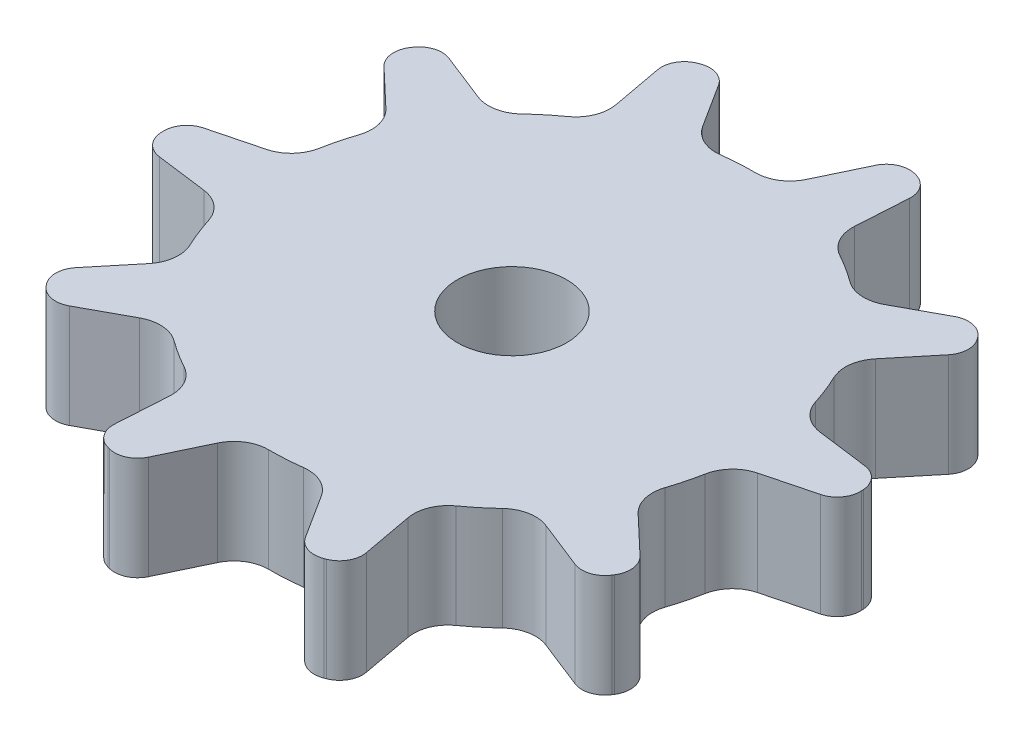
ISO-10303-21;
HEADER;
FILE_DESCRIPTION(('STEP AP214'),'2;1');
FILE_NAME('part.step','',(''),(''),'','','');
FILE_SCHEMA(('AUTOMOTIVE_DESIGN { 1 0 10303 214 1 1 1 1 }'));
ENDSEC;
DATA;
#1=APPLICATION_CONTEXT('core data for automotive mechanical design processes');
#2=APPLICATION_PROTOCOL_DEFINITION('international standard','automotive_design',2000,#1);
#3=PRODUCT_CONTEXT('',#1,'mechanical');
#4=PRODUCT('Part','Part','',(#3));
#5=PRODUCT_RELATED_PRODUCT_CATEGORY('part','',(#4));
#6=PRODUCT_DEFINITION_FORMATION('','',#4);
#7=PRODUCT_DEFINITION_CONTEXT('part definition',#1,'design');
#8=PRODUCT_DEFINITION('design','',#6,#7);
#9=PRODUCT_DEFINITION_SHAPE('','',#8);
#10=(LENGTH_UNIT() NAMED_UNIT(*) SI_UNIT(.MILLI.,.METRE.));
#11=(NAMED_UNIT(*) PLANE_ANGLE_UNIT() SI_UNIT($,.RADIAN.));
#12=(NAMED_UNIT(*) SI_UNIT($,.STERADIAN.) SOLID_ANGLE_UNIT());
#13=UNCERTAINTY_MEASURE_WITH_UNIT(LENGTH_MEASURE(1.E-05),#10,'distance_accuracy_value','');
#14=(GEOMETRIC_REPRESENTATION_CONTEXT(3) GLOBAL_UNCERTAINTY_ASSIGNED_CONTEXT((#13)) GLOBAL_UNIT_ASSIGNED_CONTEXT((#10,
#11,#12)) REPRESENTATION_CONTEXT('',''));
#15=CARTESIAN_POINT('',(0.,0.,0.));
#16=DIRECTION('',(0.,0.,1.));
#17=DIRECTION('',(1.,0.,0.));
#18=AXIS2_PLACEMENT_3D('',#15,#16,#17);
#19=CARTESIAN_POINT('',(56.2916512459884,9.,32.5000000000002));
#20=DIRECTION('',(0.,-1.,0.));
#21=DIRECTION('',(0.843391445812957,0.,0.537299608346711));
#22=AXIS2_PLACEMENT_3D('',#19,#20,#21);
#23=CYLINDRICAL_SURFACE('',#22,28.75);
#24=CARTESIAN_POINT('',(56.2916512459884,0.,32.5000000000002));
#25=DIRECTION('',(0.,1.,0.));
#26=DIRECTION('',(-0.843391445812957,0.,-0.537299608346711));
#27=AXIS2_PLACEMENT_3D('',#24,#25,#26);
#28=CIRCLE('',#27,28.75);
#29=CARTESIAN_POINT('',(63.573048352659,0.,4.68734539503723));
#30=VERTEX_POINT('',#29);
#31=CARTESIAN_POINT('',(63.4070403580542,0.,4.64441280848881));
#32=VERTEX_POINT('',#31);
#33=EDGE_CURVE('E1132',#30,#32,#28,.T.);
#34=ORIENTED_EDGE('',*,*,#33,.T.);
#35=DIRECTION('',(0.,-1.,0.));
#36=VECTOR('',#35,1.);
#37=CARTESIAN_POINT('',(63.4070403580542,9.,4.64441280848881));
#38=LINE('',#37,#36);
#39=CARTESIAN_POINT('',(63.4070403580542,9.,4.64441280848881));
#40=VERTEX_POINT('',#39);
#41=EDGE_CURVE('E1001',#32,#40,#38,.F.);
#42=ORIENTED_EDGE('',*,*,#41,.T.);
#43=CARTESIAN_POINT('',(56.2916512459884,9.,32.5000000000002));
#44=DIRECTION('',(0.,1.,0.));
#45=DIRECTION('',(-0.843391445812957,0.,-0.537299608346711));
#46=AXIS2_PLACEMENT_3D('',#43,#44,#45);
#47=CIRCLE('',#46,28.75);
#48=CARTESIAN_POINT('',(63.573048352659,9.,4.68734539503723));
#49=VERTEX_POINT('',#48);
#50=EDGE_CURVE('E1351',#49,#40,#47,.T.);
#51=ORIENTED_EDGE('',*,*,#50,.F.);
#52=DIRECTION('',(0.,-1.,0.));
#53=VECTOR('',#52,1.);
#54=CARTESIAN_POINT('',(63.573048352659,9.,4.68734539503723));
#55=LINE('',#54,#53);
#56=EDGE_CURVE('E999',#49,#30,#55,.T.);
#57=ORIENTED_EDGE('',*,*,#56,.T.);
#58=EDGE_LOOP('',(#34,#42,#51,#57));
#59=FACE_BOUND('',#58,.T.);
#60=ADVANCED_FACE('F36',(#59),#23,.T.);
#61=CARTESIAN_POINT('',(45.8345570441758,0.,5.71919193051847));
#62=VERTEX_POINT('',#61);
#63=CARTESIAN_POINT('',(45.6750186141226,0.,5.78203578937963));
#64=VERTEX_POINT('',#63);
#65=EDGE_CURVE('E1137',#62,#64,#28,.T.);
#66=ORIENTED_EDGE('',*,*,#65,.T.);
#67=DIRECTION('',(0.,-1.,0.));
#68=VECTOR('',#67,1.);
#69=CARTESIAN_POINT('',(45.6750186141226,9.,5.78203578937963));
#70=LINE('',#69,#68);
#71=CARTESIAN_POINT('',(45.6750186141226,9.,5.78203578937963));
#72=VERTEX_POINT('',#71);
#73=EDGE_CURVE('E983',#64,#72,#70,.F.);
#74=ORIENTED_EDGE('',*,*,#73,.T.);
#75=CARTESIAN_POINT('',(45.8345570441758,9.,5.71919193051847));
#76=VERTEX_POINT('',#75);
#77=EDGE_CURVE('E1352',#76,#72,#47,.T.);
#78=ORIENTED_EDGE('',*,*,#77,.F.);
#79=DIRECTION('',(0.,-1.,0.));
#80=VECTOR('',#79,1.);
#81=CARTESIAN_POINT('',(45.8345570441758,9.,5.71919193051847));
#82=LINE('',#81,#80);
#83=EDGE_CURVE('E981',#76,#62,#82,.T.);
#84=ORIENTED_EDGE('',*,*,#83,.T.);
#85=EDGE_LOOP('',(#66,#74,#78,#84));
#86=FACE_BOUND('',#85,.T.);
#87=ADVANCED_FACE('F1207',(#86),#23,.T.);
#88=CARTESIAN_POINT('',(78.530293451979,0.,14.2789876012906));
#89=VERTEX_POINT('',#88);
#90=CARTESIAN_POINT('',(78.4212253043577,0.,14.1466773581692));
#91=VERTEX_POINT('',#90);
#92=EDGE_CURVE('E1054',#89,#91,#28,.T.);
#93=ORIENTED_EDGE('',*,*,#92,.T.);
#94=DIRECTION('',(0.,-1.,0.));
#95=VECTOR('',#94,1.);
#96=CARTESIAN_POINT('',(78.4212253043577,9.,14.1466773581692));
#97=LINE('',#96,#95);
#98=CARTESIAN_POINT('',(78.4212253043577,9.,14.1466773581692));
#99=VERTEX_POINT('',#98);
#100=EDGE_CURVE('E1019',#91,#99,#97,.F.);
#101=ORIENTED_EDGE('',*,*,#100,.T.);
#102=CARTESIAN_POINT('',(78.530293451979,9.,14.2789876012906));
#103=VERTEX_POINT('',#102);
#104=EDGE_CURVE('E1196',#103,#99,#47,.T.);
#105=ORIENTED_EDGE('',*,*,#104,.F.);
#106=DIRECTION('',(0.,-1.,0.));
#107=VECTOR('',#106,1.);
#108=CARTESIAN_POINT('',(78.530293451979,9.,14.2789876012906));
#109=LINE('',#108,#107);
#110=EDGE_CURVE('E1017',#103,#89,#109,.T.);
#111=ORIENTED_EDGE('',*,*,#110,.T.);
#112=EDGE_LOOP('',(#93,#101,#105,#111));
#113=FACE_BOUND('',#112,.T.);
#114=ADVANCED_FACE('F1212',(#113),#23,.T.);
#115=CARTESIAN_POINT('',(34.0530090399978,0.,50.72101239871));
#116=VERTEX_POINT('',#115);
#117=CARTESIAN_POINT('',(34.1620771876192,0.,50.8533226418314));
#118=VERTEX_POINT('',#117);
#119=EDGE_CURVE('E1150',#116,#118,#28,.T.);
#120=ORIENTED_EDGE('',*,*,#119,.T.);
#121=DIRECTION('',(0.,-1.,0.));
#122=VECTOR('',#121,1.);
#123=CARTESIAN_POINT('',(34.1620771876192,9.,50.8533226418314));
#124=LINE('',#123,#122);
#125=CARTESIAN_POINT('',(34.1620771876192,9.,50.8533226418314));
#126=VERTEX_POINT('',#125);
#127=EDGE_CURVE('E929',#118,#126,#124,.F.);
#128=ORIENTED_EDGE('',*,*,#127,.T.);
#129=CARTESIAN_POINT('',(34.0530090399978,9.,50.72101239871));
#130=VERTEX_POINT('',#129);
#131=EDGE_CURVE('E1360',#130,#126,#47,.T.);
#132=ORIENTED_EDGE('',*,*,#131,.F.);
#133=DIRECTION('',(0.,-1.,0.));
#134=VECTOR('',#133,1.);
#135=CARTESIAN_POINT('',(34.0530090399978,9.,50.72101239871));
#136=LINE('',#135,#134);
#137=EDGE_CURVE('E927',#130,#116,#136,.T.);
#138=ORIENTED_EDGE('',*,*,#137,.T.);
#139=EDGE_LOOP('',(#120,#128,#132,#138));
#140=FACE_BOUND('',#139,.T.);
#141=ADVANCED_FACE('F1394',(#140),#23,.T.);
#142=CARTESIAN_POINT('',(49.0102541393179,0.,60.3126546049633));
#143=VERTEX_POINT('',#142);
#144=CARTESIAN_POINT('',(49.1762621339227,0.,60.3555871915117));
#145=VERTEX_POINT('',#144);
#146=EDGE_CURVE('E871',#143,#145,#28,.T.);
#147=ORIENTED_EDGE('',*,*,#146,.T.);
#148=DIRECTION('',(0.,-1.,0.));
#149=VECTOR('',#148,1.);
#150=CARTESIAN_POINT('',(49.1762621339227,9.,60.3555871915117));
#151=LINE('',#150,#149);
#152=CARTESIAN_POINT('',(49.1762621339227,9.,60.3555871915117));
#153=VERTEX_POINT('',#152);
#154=EDGE_CURVE('E911',#145,#153,#151,.F.);
#155=ORIENTED_EDGE('',*,*,#154,.T.);
#156=CARTESIAN_POINT('',(49.0102541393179,9.,60.3126546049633));
#157=VERTEX_POINT('',#156);
#158=EDGE_CURVE('E865',#157,#153,#47,.T.);
#159=ORIENTED_EDGE('',*,*,#158,.F.);
#160=DIRECTION('',(0.,-1.,0.));
#161=VECTOR('',#160,1.);
#162=CARTESIAN_POINT('',(49.0102541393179,9.,60.3126546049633));
#163=LINE('',#162,#161);
#164=EDGE_CURVE('E909',#157,#143,#163,.T.);
#165=ORIENTED_EDGE('',*,*,#164,.T.);
#166=EDGE_LOOP('',(#147,#155,#159,#165));
#167=FACE_BOUND('',#166,.T.);
#168=ADVANCED_FACE('F1369',(#167),#23,.T.);
#169=CARTESIAN_POINT('',(32.0903202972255,0.,16.9803969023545));
#170=VERTEX_POINT('',#169);
#171=CARTESIAN_POINT('',(31.9981896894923,0.,17.1250129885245));
#172=VERTEX_POINT('',#171);
#173=EDGE_CURVE('E1140',#170,#172,#28,.T.);
#174=ORIENTED_EDGE('',*,*,#173,.T.);
#175=DIRECTION('',(0.,-1.,0.));
#176=VECTOR('',#175,1.);
#177=CARTESIAN_POINT('',(31.9981896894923,9.,17.1250129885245));
#178=LINE('',#177,#176);
#179=CARTESIAN_POINT('',(31.9981896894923,9.,17.1250129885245));
#180=VERTEX_POINT('',#179);
#181=EDGE_CURVE('E965',#172,#180,#178,.F.);
#182=ORIENTED_EDGE('',*,*,#181,.T.);
#183=CARTESIAN_POINT('',(32.0903202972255,9.,16.9803969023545));
#184=VERTEX_POINT('',#183);
#185=EDGE_CURVE('E1354',#184,#180,#47,.T.);
#186=ORIENTED_EDGE('',*,*,#185,.F.);
#187=DIRECTION('',(0.,-1.,0.));
#188=VECTOR('',#187,1.);
#189=CARTESIAN_POINT('',(32.0903202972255,9.,16.9803969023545));
#190=LINE('',#189,#188);
#191=EDGE_CURVE('E963',#184,#170,#190,.T.);
#192=ORIENTED_EDGE('',*,*,#191,.T.);
#193=EDGE_LOOP('',(#174,#182,#186,#192));
#194=FACE_BOUND('',#193,.T.);
#195=ADVANCED_FACE('F1231',(#194),#23,.T.);
#196=CARTESIAN_POINT('',(27.5901693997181,0.,34.1695627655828));
#197=VERTEX_POINT('',#196);
#198=CARTESIAN_POINT('',(27.6006373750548,0.,34.3407126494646));
#199=VERTEX_POINT('',#198);
#200=EDGE_CURVE('E1145',#197,#199,#28,.T.);
#201=ORIENTED_EDGE('',*,*,#200,.T.);
#202=DIRECTION('',(0.,-1.,0.));
#203=VECTOR('',#202,1.);
#204=CARTESIAN_POINT('',(27.6006373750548,9.,34.3407126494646));
#205=LINE('',#204,#203);
#206=CARTESIAN_POINT('',(27.6006373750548,9.,34.3407126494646));
#207=VERTEX_POINT('',#206);
#208=EDGE_CURVE('E947',#199,#207,#205,.F.);
#209=ORIENTED_EDGE('',*,*,#208,.T.);
#210=CARTESIAN_POINT('',(27.5901693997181,9.,34.1695627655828));
#211=VERTEX_POINT('',#210);
#212=EDGE_CURVE('E1357',#211,#207,#47,.T.);
#213=ORIENTED_EDGE('',*,*,#212,.F.);
#214=DIRECTION('',(0.,-1.,0.));
#215=VECTOR('',#214,1.);
#216=CARTESIAN_POINT('',(27.5901693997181,9.,34.1695627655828));
#217=LINE('',#216,#215);
#218=EDGE_CURVE('E945',#211,#197,#217,.T.);
#219=ORIENTED_EDGE('',*,*,#218,.T.);
#220=EDGE_LOOP('',(#201,#209,#213,#219));
#221=FACE_BOUND('',#220,.T.);
#222=ADVANCED_FACE('F1226',(#221),#23,.T.);
#223=CARTESIAN_POINT('',(66.7487454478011,0.,59.2808080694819));
#224=VERTEX_POINT('',#223);
#225=CARTESIAN_POINT('',(66.9082838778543,0.,59.2179642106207));
#226=VERTEX_POINT('',#225);
#227=EDGE_CURVE('E840',#224,#226,#28,.T.);
#228=ORIENTED_EDGE('',*,*,#227,.T.);
#229=DIRECTION('',(0.,-1.,0.));
#230=VECTOR('',#229,1.);
#231=CARTESIAN_POINT('',(66.9082838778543,9.,59.2179642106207));
#232=LINE('',#231,#230);
#233=CARTESIAN_POINT('',(66.9082838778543,9.,59.2179642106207));
#234=VERTEX_POINT('',#233);
#235=EDGE_CURVE('E893',#226,#234,#232,.F.);
#236=ORIENTED_EDGE('',*,*,#235,.T.);
#237=CARTESIAN_POINT('',(66.7487454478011,9.,59.2808080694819));
#238=VERTEX_POINT('',#237);
#239=EDGE_CURVE('E862',#238,#234,#47,.T.);
#240=ORIENTED_EDGE('',*,*,#239,.F.);
#241=DIRECTION('',(0.,-1.,0.));
#242=VECTOR('',#241,1.);
#243=CARTESIAN_POINT('',(66.7487454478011,9.,59.2808080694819));
#244=LINE('',#243,#242);
#245=EDGE_CURVE('E891',#238,#224,#244,.T.);
#246=ORIENTED_EDGE('',*,*,#245,.T.);
#247=EDGE_LOOP('',(#228,#236,#240,#246));
#248=FACE_BOUND('',#247,.T.);
#249=ADVANCED_FACE('F1222',(#248),#23,.T.);
#250=CARTESIAN_POINT('',(80.4929821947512,0.,48.0196030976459));
#251=VERTEX_POINT('',#250);
#252=CARTESIAN_POINT('',(80.5851128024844,0.,47.874987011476));
#253=VERTEX_POINT('',#252);
#254=EDGE_CURVE('E866',#251,#253,#28,.T.);
#255=ORIENTED_EDGE('',*,*,#254,.T.);
#256=DIRECTION('',(0.,-1.,0.));
#257=VECTOR('',#256,1.);
#258=CARTESIAN_POINT('',(80.5851128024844,9.,47.874987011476));
#259=LINE('',#258,#257);
#260=CARTESIAN_POINT('',(80.5851128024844,9.,47.874987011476));
#261=VERTEX_POINT('',#260);
#262=EDGE_CURVE('E875',#253,#261,#259,.F.);
#263=ORIENTED_EDGE('',*,*,#262,.T.);
#264=CARTESIAN_POINT('',(80.4929821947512,9.,48.0196030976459));
#265=VERTEX_POINT('',#264);
#266=EDGE_CURVE('E868',#265,#261,#47,.T.);
#267=ORIENTED_EDGE('',*,*,#266,.F.);
#268=DIRECTION('',(0.,-1.,0.));
#269=VECTOR('',#268,1.);
#270=CARTESIAN_POINT('',(80.4929821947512,9.,48.0196030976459));
#271=LINE('',#270,#269);
#272=EDGE_CURVE('E873',#265,#251,#271,.T.);
#273=ORIENTED_EDGE('',*,*,#272,.T.);
#274=EDGE_LOOP('',(#255,#263,#267,#273));
#275=FACE_BOUND('',#274,.T.);
#276=ADVANCED_FACE('F1166',(#275),#23,.T.);
#277=CARTESIAN_POINT('',(84.9931330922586,0.,30.8304372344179));
#278=VERTEX_POINT('',#277);
#279=CARTESIAN_POINT('',(84.9826651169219,0.,30.659287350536));
#280=VERTEX_POINT('',#279);
#281=EDGE_CURVE('E872',#278,#280,#28,.T.);
#282=ORIENTED_EDGE('',*,*,#281,.T.);
#283=DIRECTION('',(0.,-1.,0.));
#284=VECTOR('',#283,1.);
#285=CARTESIAN_POINT('',(84.9826651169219,9.,30.659287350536));
#286=LINE('',#285,#284);
#287=CARTESIAN_POINT('',(84.9826651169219,9.,30.659287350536));
#288=VERTEX_POINT('',#287);
#289=EDGE_CURVE('E1037',#280,#288,#286,.F.);
#290=ORIENTED_EDGE('',*,*,#289,.T.);
#291=CARTESIAN_POINT('',(84.9931330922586,9.,30.8304372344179));
#292=VERTEX_POINT('',#291);
#293=EDGE_CURVE('E867',#292,#288,#47,.T.);
#294=ORIENTED_EDGE('',*,*,#293,.F.);
#295=DIRECTION('',(0.,-1.,0.));
#296=VECTOR('',#295,1.);
#297=CARTESIAN_POINT('',(84.9931330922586,9.,30.8304372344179));
#298=LINE('',#297,#296);
#299=EDGE_CURVE('E1035',#292,#278,#298,.T.);
#300=ORIENTED_EDGE('',*,*,#299,.T.);
#301=EDGE_LOOP('',(#282,#290,#294,#300));
#302=FACE_BOUND('',#301,.T.);
#303=ADVANCED_FACE('F1050',(#302),#23,.T.);
#304=CARTESIAN_POINT('',(1.47120726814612,9.,-2.42447454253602));
#305=DIRECTION('',(0.,1.,0.));
#306=DIRECTION('',(-0.843391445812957,0.,-0.537299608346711));
#307=AXIS2_PLACEMENT_3D('',#304,#305,#306);
#308=PLANE('',#307);
#309=CARTESIAN_POINT('',(56.2916512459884,9.,32.5000000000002));
#310=DIRECTION('',(0.,1.,0.));
#311=DIRECTION('',(-0.843391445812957,0.,-0.537299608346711));
#312=AXIS2_PLACEMENT_3D('',#309,#310,#311);
#313=CIRCLE('',#312,4.75);
#314=CARTESIAN_POINT('',(52.2855418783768,9.,29.9478268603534));
#315=VERTEX_POINT('',#314);
#316=EDGE_CURVE('E1568',#315,#315,#313,.T.);
#317=ORIENTED_EDGE('',*,*,#316,.F.);
#318=EDGE_LOOP('',(#317));
#319=FACE_BOUND('',#318,.T.);
#320=ORIENTED_EDGE('',*,*,#293,.T.);
#321=CARTESIAN_POINT('',(82.9867684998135,9.,30.7873369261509));
#322=DIRECTION('',(0.,1.,0.));
#323=DIRECTION('',(-0.843391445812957,0.,-0.537299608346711));
#324=AXIS2_PLACEMENT_3D('',#321,#322,#323);
#325=CIRCLE('',#324,2.);
#326=CARTESIAN_POINT('',(83.2478208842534,9.,28.8044472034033));
#327=VERTEX_POINT('',#326);
#328=EDGE_CURVE('E1042',#288,#327,#325,.T.);
#329=ORIENTED_EDGE('',*,*,#328,.T.);
#330=DIRECTION('',(0.991444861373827,0.,0.13052619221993));
#331=VECTOR('',#330,1.);
#332=CARTESIAN_POINT('',(84.8293625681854,9.,29.0126611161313));
#333=LINE('',#332,#331);
#334=CARTESIAN_POINT('',(78.7761020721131,9.,28.215734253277));
#335=VERTEX_POINT('',#334);
#336=EDGE_CURVE('E553',#335,#327,#333,.T.);
#337=ORIENTED_EDGE('',*,*,#336,.F.);
#338=CARTESIAN_POINT('',(79.1676806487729,9.,25.2413996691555));
#339=DIRECTION('',(0.,1.,0.));
#340=DIRECTION('',(0.99813479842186,0.,-0.0610485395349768));
#341=AXIS2_PLACEMENT_3D('',#338,#339,#340);
#342=CIRCLE('',#341,3.);
#343=CARTESIAN_POINT('',(76.3081769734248,9.,26.1487247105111));
#344=VERTEX_POINT('',#343);
#345=EDGE_CURVE('E1060',#344,#335,#342,.T.);
#346=ORIENTED_EDGE('',*,*,#345,.F.);
#347=CARTESIAN_POINT('',(56.2916512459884,9.,32.5000000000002));
#348=DIRECTION('',(0.,-1.,0.));
#349=DIRECTION('',(-0.771624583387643,0.,0.636078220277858));
#350=AXIS2_PLACEMENT_3D('',#347,#348,#349);
#351=CIRCLE('',#350,21.);
#352=CARTESIAN_POINT('',(75.2623707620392,9.,23.4937909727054));
#353=VERTEX_POINT('',#352);
#354=EDGE_CURVE('E542',#353,#344,#351,.T.);
#355=ORIENTED_EDGE('',*,*,#354,.F.);
#356=CARTESIAN_POINT('',(77.9724735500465,9.,22.2071896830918));
#357=DIRECTION('',(0.,1.,0.));
#358=DIRECTION('',(-0.771624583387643,0.,0.636078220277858));
#359=AXIS2_PLACEMENT_3D('',#356,#357,#358);
#360=CIRCLE('',#359,3.);
#361=CARTESIAN_POINT('',(75.6575997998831,9.,20.2989550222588));
#362=VERTEX_POINT('',#361);
#363=EDGE_CURVE('E566',#362,#353,#360,.T.);
#364=ORIENTED_EDGE('',*,*,#363,.F.);
#365=DIRECTION('',(-0.636078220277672,0.,0.771624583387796));
#366=VECTOR('',#365,1.);
#367=CARTESIAN_POINT('',(79.5411714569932,9.,15.5878058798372));
#368=LINE('',#367,#366);
#369=CARTESIAN_POINT('',(78.5265066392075,9.,16.8186927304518));
#370=VERTEX_POINT('',#369);
#371=EDGE_CURVE('E562',#370,#362,#368,.T.);
#372=ORIENTED_EDGE('',*,*,#371,.F.);
#373=CARTESIAN_POINT('',(76.9832574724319,9.,15.5465362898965));
#374=DIRECTION('',(0.,1.,0.));
#375=DIRECTION('',(-0.843391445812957,0.,-0.537299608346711));
#376=AXIS2_PLACEMENT_3D('',#373,#374,#375);
#377=CIRCLE('',#376,2.);
#378=EDGE_CURVE('E1022',#370,#103,#377,.T.);
#379=ORIENTED_EDGE('',*,*,#378,.T.);
#380=ORIENTED_EDGE('',*,*,#104,.T.);
#381=CARTESIAN_POINT('',(76.8817766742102,9.,15.4234302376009));
#382=DIRECTION('',(0.,1.,0.));
#383=DIRECTION('',(-0.843391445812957,0.,-0.537299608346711));
#384=AXIS2_PLACEMENT_3D('',#381,#382,#383);
#385=CIRCLE('',#384,2.);
#386=CARTESIAN_POINT('',(75.9274591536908,9.,13.6657960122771));
#387=VERTEX_POINT('',#386);
#388=EDGE_CURVE('E1024',#99,#387,#385,.T.);
#389=ORIENTED_EDGE('',*,*,#388,.T.);
#390=DIRECTION('',(0.878817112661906,0.,-0.477158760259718));
#391=VECTOR('',#390,1.);
#392=CARTESIAN_POINT('',(77.3293383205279,9.,12.9046377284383));
#393=LINE('',#392,#391);
#394=CARTESIAN_POINT('',(71.9637258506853,9.,15.8179276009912));
#395=VERTEX_POINT('',#394);
#396=EDGE_CURVE('E1072',#395,#387,#393,.T.);
#397=ORIENTED_EDGE('',*,*,#396,.F.);
#398=CARTESIAN_POINT('',(70.5322495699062,9.,13.1814762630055));
#399=DIRECTION('',(0.,1.,0.));
#400=DIRECTION('',(0.771624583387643,0.,-0.636078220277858));
#401=AXIS2_PLACEMENT_3D('',#398,#399,#400);
#402=CIRCLE('',#401,3.);
#403=CARTESIAN_POINT('',(68.7521747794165,9.,15.5962917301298));
#404=VERTEX_POINT('',#403);
#405=EDGE_CURVE('E1076',#404,#395,#402,.T.);
#406=ORIENTED_EDGE('',*,*,#405,.F.);
#407=CARTESIAN_POINT('',(56.2916512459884,9.,32.5000000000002));
#408=DIRECTION('',(0.,-1.,0.));
#409=DIRECTION('',(-0.250380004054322,0.,0.968147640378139));
#410=AXIS2_PLACEMENT_3D('',#407,#408,#409);
#411=CIRCLE('',#410,21.);
#412=CARTESIAN_POINT('',(66.3455688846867,9.,14.0631146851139));
#413=VERTEX_POINT('',#412);
#414=EDGE_CURVE('E609',#413,#404,#411,.T.);
#415=ORIENTED_EDGE('',*,*,#414,.F.);
#416=CARTESIAN_POINT('',(67.7818428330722,9.,11.4292739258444));
#417=DIRECTION('',(0.,1.,0.));
#418=DIRECTION('',(-0.250380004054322,0.,0.968147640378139));
#419=AXIS2_PLACEMENT_3D('',#416,#417,#418);
#420=CIRCLE('',#419,3.);
#421=CARTESIAN_POINT('',(64.7874384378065,9.,11.2461283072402));
#422=VERTEX_POINT('',#421);
#423=EDGE_CURVE('E606',#422,#413,#420,.T.);
#424=ORIENTED_EDGE('',*,*,#423,.F.);
#425=DIRECTION('',(-0.0610485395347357,0.,0.998134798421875));
#426=VECTOR('',#425,1.);
#427=CARTESIAN_POINT('',(65.1601699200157,9.,5.15202244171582));
#428=LINE('',#427,#426);
#429=CARTESIAN_POINT('',(65.0627859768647,9.,6.74423583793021));
#430=VERTEX_POINT('',#429);
#431=EDGE_CURVE('E600',#430,#422,#428,.T.);
#432=ORIENTED_EDGE('',*,*,#431,.F.);
#433=CARTESIAN_POINT('',(63.066516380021,9.,6.62213875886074));
#434=DIRECTION('',(0.,1.,0.));
#435=DIRECTION('',(-0.843391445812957,0.,-0.537299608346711));
#436=AXIS2_PLACEMENT_3D('',#433,#434,#435);
#437=CIRCLE('',#436,2.);
#438=EDGE_CURVE('E1004',#430,#49,#437,.T.);
#439=ORIENTED_EDGE('',*,*,#438,.T.);
#440=ORIENTED_EDGE('',*,*,#50,.T.);
#441=CARTESIAN_POINT('',(62.9120567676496,9.,6.58219278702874));
#442=DIRECTION('',(0.,1.,0.));
#443=DIRECTION('',(-0.843391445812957,0.,-0.537299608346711));
#444=AXIS2_PLACEMENT_3D('',#441,#442,#443);
#445=CIRCLE('',#444,2.);
#446=CARTESIAN_POINT('',(61.1068861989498,9.,5.72117059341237));
#447=VERTEX_POINT('',#446);
#448=EDGE_CURVE('E1006',#40,#447,#445,.T.);
#449=ORIENTED_EDGE('',*,*,#448,.T.);
#450=DIRECTION('',(0.430511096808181,0.,-0.902585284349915));
#451=VECTOR('',#450,1.);
#452=CARTESIAN_POINT('',(61.7936326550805,9.,4.28137670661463));
#453=LINE('',#452,#451);
#454=CARTESIAN_POINT('',(59.1651498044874,9.,9.79210560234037));
#455=VERTEX_POINT('',#454);
#456=EDGE_CURVE('E1103',#455,#447,#453,.T.);
#457=ORIENTED_EDGE('',*,*,#456,.F.);
#458=CARTESIAN_POINT('',(56.4573939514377,9.,8.50057231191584));
#459=DIRECTION('',(0.,1.,0.));
#460=DIRECTION('',(0.250380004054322,0.,-0.968147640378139));
#461=AXIS2_PLACEMENT_3D('',#458,#459,#460);
#462=CIRCLE('',#461,3.);
#463=CARTESIAN_POINT('',(56.4366761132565,9.,11.5005007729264));
#464=VERTEX_POINT('',#463);
#465=EDGE_CURVE('E575',#464,#455,#462,.T.);
#466=ORIENTED_EDGE('',*,*,#465,.F.);
#467=CARTESIAN_POINT('',(56.2916512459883,9.,32.5000000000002));
#468=DIRECTION('',(0.,-1.,0.));
#469=DIRECTION('',(0.366501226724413,0.,0.930417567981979));
#470=AXIS2_PLACEMENT_3D('',#467,#468,#469);
#471=CIRCLE('',#470,21.);
#472=CARTESIAN_POINT('',(53.5885121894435,9.,11.6747019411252));
#473=VERTEX_POINT('',#472);
#474=EDGE_CURVE('E647',#473,#464,#471,.T.);
#475=ORIENTED_EDGE('',*,*,#474,.F.);
#476=CARTESIAN_POINT('',(53.2023494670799,9.,8.69965936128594));
#477=DIRECTION('',(0.,1.,0.));
#478=DIRECTION('',(0.366501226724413,0.,0.930417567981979));
#479=AXIS2_PLACEMENT_3D('',#476,#477,#478);
#480=CIRCLE('',#479,3.);
#481=CARTESIAN_POINT('',(50.6721751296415,9.,10.3115581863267));
#482=VERTEX_POINT('',#481);
#483=EDGE_CURVE('E593',#482,#473,#480,.T.);
#484=ORIENTED_EDGE('',*,*,#483,.F.);
#485=DIRECTION('',(0.537299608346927,0.,0.84339144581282));
#486=VECTOR('',#485,1.);
#487=CARTESIAN_POINT('',(47.391695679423,9.,5.16223690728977));
#488=LINE('',#487,#486);
#489=CARTESIAN_POINT('',(48.2487899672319,9.,6.5076054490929));
#490=VERTEX_POINT('',#489);
#491=EDGE_CURVE('E639',#490,#482,#488,.T.);
#492=ORIENTED_EDGE('',*,*,#491,.F.);
#493=CARTESIAN_POINT('',(46.5620070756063,9.,7.58220466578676));
#494=DIRECTION('',(0.,1.,0.));
#495=DIRECTION('',(-0.843391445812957,0.,-0.537299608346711));
#496=AXIS2_PLACEMENT_3D('',#493,#494,#495);
#497=CIRCLE('',#496,2.);
#498=EDGE_CURVE('E986',#490,#76,#497,.T.);
#499=ORIENTED_EDGE('',*,*,#498,.T.);
#500=ORIENTED_EDGE('',*,*,#77,.T.);
#501=CARTESIAN_POINT('',(46.4135669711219,9.,7.64067677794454));
#502=DIRECTION('',(0.,1.,0.));
#503=DIRECTION('',(-0.843391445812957,0.,-0.537299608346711));
#504=AXIS2_PLACEMENT_3D('',#501,#502,#503);
#505=CIRCLE('',#504,2.);
#506=CARTESIAN_POINT('',(44.4470571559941,9.,8.00514782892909));
#507=VERTEX_POINT('',#506);
#508=EDGE_CURVE('E988',#72,#507,#505,.T.);
#509=ORIENTED_EDGE('',*,*,#508,.T.);
#510=DIRECTION('',(-0.182235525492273,0.,-0.983254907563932));
#511=VECTOR('',#510,1.);
#512=CARTESIAN_POINT('',(44.15635709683,9.,6.4366706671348));
#513=LINE('',#512,#511);
#514=CARTESIAN_POINT('',(45.2689949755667,9.,12.4399274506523));
#515=VERTEX_POINT('',#514);
#516=EDGE_CURVE('E581',#515,#507,#513,.T.);
#517=ORIENTED_EDGE('',*,*,#516,.F.);
#518=CARTESIAN_POINT('',(42.3192302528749,9.,12.9866340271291));
#519=DIRECTION('',(0.,1.,0.));
#520=DIRECTION('',(-0.366501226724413,0.,-0.930417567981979));
#521=AXIS2_PLACEMENT_3D('',#518,#519,#520);
#522=CIRCLE('',#521,3.);
#523=CARTESIAN_POINT('',(44.0657828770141,9.,15.425804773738));
#524=VERTEX_POINT('',#523);
#525=EDGE_CURVE('E585',#524,#515,#522,.T.);
#526=ORIENTED_EDGE('',*,*,#525,.F.);
#527=CARTESIAN_POINT('',(56.2916512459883,9.,32.5000000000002));
#528=DIRECTION('',(0.,-1.,0.));
#529=DIRECTION('',(0.843391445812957,0.,0.537299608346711));
#530=AXIS2_PLACEMENT_3D('',#527,#528,#529);
#531=CIRCLE('',#530,21.);
#532=CARTESIAN_POINT('',(41.863962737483,9.,17.2408452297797));
#533=VERTEX_POINT('',#532);
#534=EDGE_CURVE('E684',#533,#524,#531,.T.);
#535=ORIENTED_EDGE('',*,*,#534,.F.);
#536=CARTESIAN_POINT('',(39.8028643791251,9.,15.0609659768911));
#537=DIRECTION('',(0.,1.,0.));
#538=DIRECTION('',(0.843391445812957,0.,0.537299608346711));
#539=AXIS2_PLACEMENT_3D('',#536,#537,#538);
#540=CIRCLE('',#539,3.);
#541=CARTESIAN_POINT('',(38.7033606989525,9.,17.8522186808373));
#542=VERTEX_POINT('',#541);
#543=EDGE_CURVE('E632',#542,#533,#540,.T.);
#544=ORIENTED_EDGE('',*,*,#543,.F.);
#545=DIRECTION('',(0.930417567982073,0.,0.366501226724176));
#546=VECTOR('',#545,1.);
#547=CARTESIAN_POINT('',(33.0227019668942,9.,15.6145476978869));
#548=LINE('',#547,#546);
#549=CARTESIAN_POINT('',(34.5068935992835,9.,16.1991863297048));
#550=VERTEX_POINT('',#549);
#551=EDGE_CURVE('E676',#550,#542,#548,.T.);
#552=ORIENTED_EDGE('',*,*,#551,.F.);
#553=CARTESIAN_POINT('',(33.7738911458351,9.,18.060021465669));
#554=DIRECTION('',(0.,1.,0.));
#555=DIRECTION('',(-0.843391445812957,0.,-0.537299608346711));
#556=AXIS2_PLACEMENT_3D('',#553,#554,#555);
#557=CIRCLE('',#556,2.);
#558=EDGE_CURVE('E968',#550,#184,#557,.T.);
#559=ORIENTED_EDGE('',*,*,#558,.T.);
#560=ORIENTED_EDGE('',*,*,#185,.T.);
#561=CARTESIAN_POINT('',(33.6881696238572,9.,18.1945773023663));
#562=DIRECTION('',(0.,1.,0.));
#563=DIRECTION('',(-0.843391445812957,0.,-0.537299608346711));
#564=AXIS2_PLACEMENT_3D('',#561,#562,#563);
#565=CIRCLE('',#564,2.);
#566=CARTESIAN_POINT('',(32.3114604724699,9.,19.645326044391));
#567=VERTEX_POINT('',#566);
#568=EDGE_CURVE('E970',#180,#567,#565,.T.);
#569=ORIENTED_EDGE('',*,*,#568,.T.);
#570=DIRECTION('',(-0.725374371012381,0.,-0.688354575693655));
#571=VECTOR('',#570,1.);
#572=CARTESIAN_POINT('',(31.1543514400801,9.,18.5472705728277));
#573=LINE('',#572,#571);
#574=CARTESIAN_POINT('',(35.5831201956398,9.,22.7500151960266));
#575=VERTEX_POINT('',#574);
#576=EDGE_CURVE('E620',#575,#567,#573,.T.);
#577=ORIENTED_EDGE('',*,*,#576,.F.);
#578=CARTESIAN_POINT('',(33.5180564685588,9.,24.9261383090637));
#579=DIRECTION('',(0.,1.,0.));
#580=DIRECTION('',(-0.843391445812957,0.,-0.537299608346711));
#581=AXIS2_PLACEMENT_3D('',#578,#579,#580);
#582=CIRCLE('',#581,3.);
#583=CARTESIAN_POINT('',(36.3647558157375,9.,25.8728710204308));
#584=VERTEX_POINT('',#583);
#585=EDGE_CURVE('E624',#584,#575,#582,.T.);
#586=ORIENTED_EDGE('',*,*,#585,.F.);
#587=CARTESIAN_POINT('',(56.2916512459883,9.,32.5000000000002));
#588=DIRECTION('',(0.,-1.,0.));
#589=DIRECTION('',(0.998134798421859,0.,-0.0610485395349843));
#590=AXIS2_PLACEMENT_3D('',#587,#588,#589);
#591=CIRCLE('',#590,21.);
#592=CARTESIAN_POINT('',(35.6502999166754,9.,28.6354670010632));
#593=VERTEX_POINT('',#592);
#594=EDGE_CURVE('E721',#593,#584,#591,.T.);
#595=ORIENTED_EDGE('',*,*,#594,.F.);
#596=CARTESIAN_POINT('',(32.7015354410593,9.,28.083390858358));
#597=DIRECTION('',(0.,1.,0.));
#598=DIRECTION('',(0.998134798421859,0.,-0.0610485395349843));
#599=AXIS2_PLACEMENT_3D('',#596,#597,#598);
#600=CIRCLE('',#599,3.);
#601=CARTESIAN_POINT('',(33.452675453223,9.,30.9878337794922));
#602=VERTEX_POINT('',#601);
#603=EDGE_CURVE('E669',#602,#593,#600,.T.);
#604=ORIENTED_EDGE('',*,*,#603,.F.);
#605=DIRECTION('',(0.968147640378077,0.,-0.250380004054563));
#606=VECTOR('',#605,1.);
#607=CARTESIAN_POINT('',(27.5416559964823,9.,32.5165273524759));
#608=LINE('',#607,#606);
#609=CARTESIAN_POINT('',(29.0860342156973,9.,32.1171239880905));
#610=VERTEX_POINT('',#609);
#611=EDGE_CURVE('E713',#610,#602,#608,.T.);
#612=ORIENTED_EDGE('',*,*,#611,.F.);
#613=CARTESIAN_POINT('',(29.5867942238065,9.,34.0534192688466));
#614=DIRECTION('',(0.,1.,0.));
#615=DIRECTION('',(-0.843391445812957,0.,-0.537299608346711));
#616=AXIS2_PLACEMENT_3D('',#613,#614,#615);
#617=CIRCLE('',#616,2.);
#618=EDGE_CURVE('E950',#610,#211,#617,.T.);
#619=ORIENTED_EDGE('',*,*,#618,.T.);
#620=ORIENTED_EDGE('',*,*,#212,.T.);
#621=CARTESIAN_POINT('',(29.5965339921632,9.,34.2126630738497));
#622=DIRECTION('',(0.,1.,0.));
#623=DIRECTION('',(-0.843391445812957,0.,-0.537299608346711));
#624=AXIS2_PLACEMENT_3D('',#621,#622,#623);
#625=CIRCLE('',#624,2.);
#626=CARTESIAN_POINT('',(29.3354816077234,9.,36.1955527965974));
#627=VERTEX_POINT('',#626);
#628=EDGE_CURVE('E952',#207,#627,#625,.T.);
#629=ORIENTED_EDGE('',*,*,#628,.T.);
#630=DIRECTION('',(-0.991444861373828,0.,-0.130526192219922));
#631=VECTOR('',#630,1.);
#632=CARTESIAN_POINT('',(27.7539399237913,9.,35.9873388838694));
#633=LINE('',#632,#631);
#634=CARTESIAN_POINT('',(33.8072004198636,9.,36.7842657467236));
#635=VERTEX_POINT('',#634);
#636=EDGE_CURVE('E657',#635,#627,#633,.T.);
#637=ORIENTED_EDGE('',*,*,#636,.F.);
#638=CARTESIAN_POINT('',(33.4156218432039,9.,39.7586003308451));
#639=DIRECTION('',(0.,1.,0.));
#640=DIRECTION('',(-0.998134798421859,0.,0.0610485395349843));
#641=AXIS2_PLACEMENT_3D('',#638,#639,#640);
#642=CIRCLE('',#641,3.);
#643=CARTESIAN_POINT('',(36.2751255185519,9.,38.8512752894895));
#644=VERTEX_POINT('',#643);
#645=EDGE_CURVE('E661',#644,#635,#642,.T.);
#646=ORIENTED_EDGE('',*,*,#645,.F.);
#647=CARTESIAN_POINT('',(56.2916512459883,9.,32.5000000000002));
#648=DIRECTION('',(0.,-1.,0.));
#649=DIRECTION('',(0.771624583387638,0.,-0.636078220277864));
#650=AXIS2_PLACEMENT_3D('',#647,#648,#649);
#651=CIRCLE('',#650,21.);
#652=CARTESIAN_POINT('',(37.3209317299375,9.,41.5062090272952));
#653=VERTEX_POINT('',#652);
#654=EDGE_CURVE('E758',#653,#644,#651,.T.);
#655=ORIENTED_EDGE('',*,*,#654,.F.);
#656=CARTESIAN_POINT('',(34.6108289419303,9.,42.7928103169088));
#657=DIRECTION('',(0.,1.,0.));
#658=DIRECTION('',(0.771624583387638,0.,-0.636078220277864));
#659=AXIS2_PLACEMENT_3D('',#656,#657,#658);
#660=CIRCLE('',#659,3.);
#661=CARTESIAN_POINT('',(36.9257026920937,9.,44.7010449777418));
#662=VERTEX_POINT('',#661);
#663=EDGE_CURVE('E706',#662,#653,#660,.T.);
#664=ORIENTED_EDGE('',*,*,#663,.F.);
#665=DIRECTION('',(0.636078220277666,0.,-0.771624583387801));
#666=VECTOR('',#665,1.);
#667=CARTESIAN_POINT('',(33.0421310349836,9.,49.4121941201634));
#668=LINE('',#667,#666);
#669=CARTESIAN_POINT('',(34.0567958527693,9.,48.1813072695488));
#670=VERTEX_POINT('',#669);
#671=EDGE_CURVE('E750',#670,#662,#668,.T.);
#672=ORIENTED_EDGE('',*,*,#671,.F.);
#673=CARTESIAN_POINT('',(35.6000450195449,9.,49.4534637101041));
#674=DIRECTION('',(0.,1.,0.));
#675=DIRECTION('',(-0.843391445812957,0.,-0.537299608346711));
#676=AXIS2_PLACEMENT_3D('',#673,#674,#675);
#677=CIRCLE('',#676,2.);
#678=EDGE_CURVE('E932',#670,#130,#677,.T.);
#679=ORIENTED_EDGE('',*,*,#678,.T.);
#680=ORIENTED_EDGE('',*,*,#131,.T.);
#681=CARTESIAN_POINT('',(35.7015258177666,9.,49.5765697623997));
#682=DIRECTION('',(0.,1.,0.));
#683=DIRECTION('',(-0.843391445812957,0.,-0.537299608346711));
#684=AXIS2_PLACEMENT_3D('',#681,#682,#683);
#685=CIRCLE('',#684,2.);
#686=CARTESIAN_POINT('',(36.655843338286,9.,51.3342039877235));
#687=VERTEX_POINT('',#686);
#688=EDGE_CURVE('E934',#126,#687,#685,.T.);
#689=ORIENTED_EDGE('',*,*,#688,.T.);
#690=DIRECTION('',(-0.878817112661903,0.,0.477158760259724));
#691=VECTOR('',#690,1.);
#692=CARTESIAN_POINT('',(35.253964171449,9.,52.0953622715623));
#693=LINE('',#692,#691);
#694=CARTESIAN_POINT('',(40.6195766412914,9.,49.1820723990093));
#695=VERTEX_POINT('',#694);
#696=EDGE_CURVE('E694',#695,#687,#693,.T.);
#697=ORIENTED_EDGE('',*,*,#696,.F.);
#698=CARTESIAN_POINT('',(42.0510529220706,9.,51.8185237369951));
#699=DIRECTION('',(0.,1.,0.));
#700=DIRECTION('',(-0.771624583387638,0.,0.636078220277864));
#701=AXIS2_PLACEMENT_3D('',#698,#699,#700);
#702=CIRCLE('',#701,3.);
#703=CARTESIAN_POINT('',(43.8311277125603,9.,49.4037082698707));
#704=VERTEX_POINT('',#703);
#705=EDGE_CURVE('E698',#704,#695,#702,.T.);
#706=ORIENTED_EDGE('',*,*,#705,.F.);
#707=CARTESIAN_POINT('',(56.2916512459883,9.,32.5000000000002));
#708=DIRECTION('',(0.,-1.,0.));
#709=DIRECTION('',(0.250380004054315,0.,-0.968147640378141));
#710=AXIS2_PLACEMENT_3D('',#707,#708,#709);
#711=CIRCLE('',#710,21.);
#712=CARTESIAN_POINT('',(46.2377336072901,9.,50.9368853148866));
#713=VERTEX_POINT('',#712);
#714=EDGE_CURVE('E795',#713,#704,#711,.T.);
#715=ORIENTED_EDGE('',*,*,#714,.F.);
#716=CARTESIAN_POINT('',(44.8014596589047,9.,53.5707260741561));
#717=DIRECTION('',(0.,1.,0.));
#718=DIRECTION('',(0.250380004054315,0.,-0.968147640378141));
#719=AXIS2_PLACEMENT_3D('',#716,#717,#718);
#720=CIRCLE('',#719,3.);
#721=CARTESIAN_POINT('',(47.7958640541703,9.,53.7538716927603));
#722=VERTEX_POINT('',#721);
#723=EDGE_CURVE('E743',#722,#713,#720,.T.);
#724=ORIENTED_EDGE('',*,*,#723,.F.);
#725=DIRECTION('',(0.0610485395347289,0.,-0.998134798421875));
#726=VECTOR('',#725,1.);
#727=CARTESIAN_POINT('',(47.4231325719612,9.,59.8479775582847));
#728=LINE('',#727,#726);
#729=CARTESIAN_POINT('',(47.5205165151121,9.,58.2557641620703));
#730=VERTEX_POINT('',#729);
#731=EDGE_CURVE('E787',#730,#722,#728,.T.);
#732=ORIENTED_EDGE('',*,*,#731,.F.);
#733=CARTESIAN_POINT('',(49.5167861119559,9.,58.3778612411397));
#734=DIRECTION('',(0.,1.,0.));
#735=DIRECTION('',(-0.843391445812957,0.,-0.537299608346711));
#736=AXIS2_PLACEMENT_3D('',#733,#734,#735);
#737=CIRCLE('',#736,2.);
#738=EDGE_CURVE('E914',#730,#157,#737,.T.);
#739=ORIENTED_EDGE('',*,*,#738,.T.);
#740=ORIENTED_EDGE('',*,*,#158,.T.);
#741=CARTESIAN_POINT('',(49.6712457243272,9.,58.4178072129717));
#742=DIRECTION('',(0.,1.,0.));
#743=DIRECTION('',(-0.843391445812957,0.,-0.537299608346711));
#744=AXIS2_PLACEMENT_3D('',#741,#742,#743);
#745=CIRCLE('',#744,2.);
#746=CARTESIAN_POINT('',(51.4764162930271,9.,59.2788294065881));
#747=VERTEX_POINT('',#746);
#748=EDGE_CURVE('E916',#153,#747,#745,.T.);
#749=ORIENTED_EDGE('',*,*,#748,.T.);
#750=DIRECTION('',(-0.430511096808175,0.,0.902585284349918));
#751=VECTOR('',#750,1.);
#752=CARTESIAN_POINT('',(50.7896698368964,9.,60.7186232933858));
#753=LINE('',#752,#751);
#754=CARTESIAN_POINT('',(53.4181526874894,9.,55.2078943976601));
#755=VERTEX_POINT('',#754);
#756=EDGE_CURVE('E731',#755,#747,#753,.T.);
#757=ORIENTED_EDGE('',*,*,#756,.F.);
#758=CARTESIAN_POINT('',(56.1259085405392,9.,56.4994276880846));
#759=DIRECTION('',(0.,1.,0.));
#760=DIRECTION('',(-0.250380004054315,0.,0.968147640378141));
#761=AXIS2_PLACEMENT_3D('',#758,#759,#760);
#762=CIRCLE('',#761,3.);
#763=CARTESIAN_POINT('',(56.1466263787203,9.,53.4994992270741));
#764=VERTEX_POINT('',#763);
#765=EDGE_CURVE('E735',#764,#755,#762,.T.);
#766=ORIENTED_EDGE('',*,*,#765,.F.);
#767=CARTESIAN_POINT('',(56.2916512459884,9.,32.5000000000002));
#768=DIRECTION('',(0.,-1.,0.));
#769=DIRECTION('',(-0.36650122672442,0.,-0.930417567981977));
#770=AXIS2_PLACEMENT_3D('',#767,#768,#769);
#771=CIRCLE('',#770,21.);
#772=CARTESIAN_POINT('',(58.9947903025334,9.,53.3252980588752));
#773=VERTEX_POINT('',#772);
#774=EDGE_CURVE('E813',#773,#764,#771,.T.);
#775=ORIENTED_EDGE('',*,*,#774,.F.);
#776=CARTESIAN_POINT('',(59.380953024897,9.,56.3003406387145));
#777=DIRECTION('',(0.,1.,0.));
#778=DIRECTION('',(-0.36650122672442,0.,-0.930417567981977));
#779=AXIS2_PLACEMENT_3D('',#776,#777,#778);
#780=CIRCLE('',#779,3.);
#781=CARTESIAN_POINT('',(61.9111273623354,9.,54.6884418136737));
#782=VERTEX_POINT('',#781);
#783=EDGE_CURVE('E780',#782,#773,#780,.T.);
#784=ORIENTED_EDGE('',*,*,#783,.F.);
#785=DIRECTION('',(-0.537299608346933,0.,-0.843391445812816));
#786=VECTOR('',#785,1.);
#787=CARTESIAN_POINT('',(65.1916068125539,9.,59.8377630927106));
#788=LINE('',#787,#786);
#789=CARTESIAN_POINT('',(64.334512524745,9.,58.4923945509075));
#790=VERTEX_POINT('',#789);
#791=EDGE_CURVE('E805',#790,#782,#788,.T.);
#792=ORIENTED_EDGE('',*,*,#791,.F.);
#793=CARTESIAN_POINT('',(66.0212954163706,9.,57.4177953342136));
#794=DIRECTION('',(0.,1.,0.));
#795=DIRECTION('',(-0.843391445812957,0.,-0.537299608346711));
#796=AXIS2_PLACEMENT_3D('',#793,#794,#795);
#797=CIRCLE('',#796,2.);
#798=EDGE_CURVE('E896',#790,#238,#797,.T.);
#799=ORIENTED_EDGE('',*,*,#798,.T.);
#800=ORIENTED_EDGE('',*,*,#239,.T.);
#801=CARTESIAN_POINT('',(66.169735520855,9.,57.3593232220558));
#802=DIRECTION('',(0.,1.,0.));
#803=DIRECTION('',(-0.843391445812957,0.,-0.537299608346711));
#804=AXIS2_PLACEMENT_3D('',#801,#802,#803);
#805=CIRCLE('',#804,2.);
#806=CARTESIAN_POINT('',(68.1362453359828,9.,56.9948521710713));
#807=VERTEX_POINT('',#806);
#808=EDGE_CURVE('E898',#234,#807,#805,.T.);
#809=ORIENTED_EDGE('',*,*,#808,.T.);
#810=DIRECTION('',(0.18223552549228,0.,0.98325490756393));
#811=VECTOR('',#810,1.);
#812=CARTESIAN_POINT('',(68.4269453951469,9.,58.5633293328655));
#813=LINE('',#812,#811);
#814=CARTESIAN_POINT('',(67.3143075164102,9.,52.560072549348));
#815=VERTEX_POINT('',#814);
#816=EDGE_CURVE('E768',#815,#807,#813,.T.);
#817=ORIENTED_EDGE('',*,*,#816,.F.);
#818=CARTESIAN_POINT('',(70.264072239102,9.,52.0133659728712));
#819=DIRECTION('',(0.,1.,0.));
#820=DIRECTION('',(0.36650122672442,0.,0.930417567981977));
#821=AXIS2_PLACEMENT_3D('',#818,#819,#820);
#822=CIRCLE('',#821,3.);
#823=CARTESIAN_POINT('',(68.5175196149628,9.,49.5741952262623));
#824=VERTEX_POINT('',#823);
#825=EDGE_CURVE('E772',#824,#815,#822,.T.);
#826=ORIENTED_EDGE('',*,*,#825,.F.);
#827=CARTESIAN_POINT('',(56.2916512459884,9.,32.5000000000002));
#828=DIRECTION('',(0.,-1.,0.));
#829=DIRECTION('',(-0.843391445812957,0.,-0.537299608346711));
#830=AXIS2_PLACEMENT_3D('',#827,#828,#829);
#831=CIRCLE('',#830,21.);
#832=CARTESIAN_POINT('',(70.7193397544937,9.,47.7591547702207));
#833=VERTEX_POINT('',#832);
#834=EDGE_CURVE('E833',#833,#824,#831,.T.);
#835=ORIENTED_EDGE('',*,*,#834,.F.);
#836=CARTESIAN_POINT('',(72.7804381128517,9.,49.9390340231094));
#837=DIRECTION('',(0.,1.,0.));
#838=DIRECTION('',(-0.843391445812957,0.,-0.537299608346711));
#839=AXIS2_PLACEMENT_3D('',#836,#837,#838);
#840=CIRCLE('',#839,3.);
#841=CARTESIAN_POINT('',(73.8799417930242,9.,47.1477813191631));
#842=VERTEX_POINT('',#841);
#843=EDGE_CURVE('E830',#842,#833,#840,.T.);
#844=ORIENTED_EDGE('',*,*,#843,.F.);
#845=DIRECTION('',(-0.930417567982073,0.,-0.366501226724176));
#846=VECTOR('',#845,1.);
#847=CARTESIAN_POINT('',(79.5606005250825,9.,49.3854523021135));
#848=LINE('',#847,#846);
#849=CARTESIAN_POINT('',(78.0764088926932,9.,48.8008136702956));
#850=VERTEX_POINT('',#849);
#851=EDGE_CURVE('E825',#850,#842,#848,.T.);
#852=ORIENTED_EDGE('',*,*,#851,.F.);
#853=CARTESIAN_POINT('',(78.8094113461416,9.,46.9399785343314));
#854=DIRECTION('',(0.,1.,0.));
#855=DIRECTION('',(-0.843391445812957,0.,-0.537299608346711));
#856=AXIS2_PLACEMENT_3D('',#853,#854,#855);
#857=CIRCLE('',#856,2.);
#858=EDGE_CURVE('E878',#850,#265,#857,.T.);
#859=ORIENTED_EDGE('',*,*,#858,.T.);
#860=ORIENTED_EDGE('',*,*,#266,.T.);
#861=CARTESIAN_POINT('',(78.8951328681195,9.,46.8054226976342));
#862=DIRECTION('',(0.,1.,0.));
#863=DIRECTION('',(-0.843391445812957,0.,-0.537299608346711));
#864=AXIS2_PLACEMENT_3D('',#861,#862,#863);
#865=CIRCLE('',#864,2.);
#866=CARTESIAN_POINT('',(80.2718420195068,9.,45.3546739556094));
#867=VERTEX_POINT('',#866);
#868=EDGE_CURVE('E880',#261,#867,#865,.T.);
#869=ORIENTED_EDGE('',*,*,#868,.T.);
#870=DIRECTION('',(0.725374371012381,0.,0.688354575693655));
#871=VECTOR('',#870,1.);
#872=CARTESIAN_POINT('',(81.4289510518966,9.,46.4527294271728));
#873=LINE('',#872,#871);
#874=CARTESIAN_POINT('',(77.0001822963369,9.,42.2499848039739));
#875=VERTEX_POINT('',#874);
#876=EDGE_CURVE('E846',#875,#867,#873,.T.);
#877=ORIENTED_EDGE('',*,*,#876,.F.);
#878=CARTESIAN_POINT('',(79.0652460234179,9.,40.0738616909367));
#879=DIRECTION('',(0.,1.,0.));
#880=DIRECTION('',(0.843391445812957,0.,0.537299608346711));
#881=AXIS2_PLACEMENT_3D('',#878,#879,#880);
#882=CIRCLE('',#881,3.);
#883=CARTESIAN_POINT('',(76.2185466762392,9.,39.1271289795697));
#884=VERTEX_POINT('',#883);
#885=EDGE_CURVE('E855',#884,#875,#882,.T.);
#886=ORIENTED_EDGE('',*,*,#885,.F.);
#887=CARTESIAN_POINT('',(56.2916512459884,9.,32.5000000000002));
#888=DIRECTION('',(0.,-1.,0.));
#889=DIRECTION('',(0.843391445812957,0.,0.537299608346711));
#890=AXIS2_PLACEMENT_3D('',#887,#888,#889);
#891=CIRCLE('',#890,21.);
#892=CARTESIAN_POINT('',(76.9330025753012,9.,36.3645329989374));
#893=VERTEX_POINT('',#892);
#894=EDGE_CURVE('E819',#893,#884,#891,.T.);
#895=ORIENTED_EDGE('',*,*,#894,.F.);
#896=CARTESIAN_POINT('',(79.8817670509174,9.,36.9166091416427));
#897=DIRECTION('',(0.,1.,0.));
#898=DIRECTION('',(-0.99813479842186,0.,0.0610485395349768));
#899=AXIS2_PLACEMENT_3D('',#896,#897,#898);
#900=CIRCLE('',#899,3.);
#901=CARTESIAN_POINT('',(79.1306270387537,9.,34.0121662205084));
#902=VERTEX_POINT('',#901);
#903=EDGE_CURVE('E1066',#902,#893,#900,.T.);
#904=ORIENTED_EDGE('',*,*,#903,.F.);
#905=DIRECTION('',(-0.968147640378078,0.,0.250380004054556));
#906=VECTOR('',#905,1.);
#907=CARTESIAN_POINT('',(85.0416464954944,9.,32.4834726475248));
#908=LINE('',#907,#906);
#909=CARTESIAN_POINT('',(83.4972682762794,9.,32.8828760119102));
#910=VERTEX_POINT('',#909);
#911=EDGE_CURVE('E1089',#910,#902,#908,.T.);
#912=ORIENTED_EDGE('',*,*,#911,.F.);
#913=CARTESIAN_POINT('',(82.9965082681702,9.,30.946580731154));
#914=DIRECTION('',(0.,1.,0.));
#915=DIRECTION('',(-0.843391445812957,0.,-0.537299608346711));
#916=AXIS2_PLACEMENT_3D('',#913,#914,#915);
#917=CIRCLE('',#916,2.);
#918=EDGE_CURVE('E1040',#910,#292,#917,.T.);
#919=ORIENTED_EDGE('',*,*,#918,.T.);
#920=EDGE_LOOP('',(#320,#329,#337,#346,#355,#364,#372,#379,#380,#389,#397,#406,#415,#424,#432,
#439,#440,#449,#457,#466,#475,#484,#492,#499,#500,#509,#517,#526,#535,#544,#552,#559,#560,#569,
#577,#586,#595,#604,#612,#619,#620,#629,#637,#646,#655,#664,#672,#679,#680,#689,#697,#706,#715,
#724,#732,#739,#740,#749,#757,#766,#775,#784,#792,#799,#800,#809,#817,#826,#835,#844,#852,#859,
#860,#869,#877,#886,#895,#904,#912,#919));
#921=FACE_BOUND('',#920,.T.);
#922=ADVANCED_FACE('F1058',(#319,#921),#308,.T.);
#923=CARTESIAN_POINT('',(1.47120726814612,0.,-2.42447454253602));
#924=DIRECTION('',(0.,1.,0.));
#925=DIRECTION('',(-0.843391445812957,0.,-0.537299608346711));
#926=AXIS2_PLACEMENT_3D('',#923,#924,#925);
#927=PLANE('',#926);
#928=CARTESIAN_POINT('',(56.2916512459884,0.,32.5000000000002));
#929=DIRECTION('',(0.,1.,0.));
#930=DIRECTION('',(-0.843391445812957,0.,-0.537299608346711));
#931=AXIS2_PLACEMENT_3D('',#928,#929,#930);
#932=CIRCLE('',#931,4.75);
#933=CARTESIAN_POINT('',(52.2855418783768,0.,29.9478268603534));
#934=VERTEX_POINT('',#933);
#935=EDGE_CURVE('E1062',#934,#934,#932,.T.);
#936=ORIENTED_EDGE('',*,*,#935,.T.);
#937=EDGE_LOOP('',(#936));
#938=FACE_BOUND('',#937,.T.);
#939=DIRECTION('',(0.991444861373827,0.,0.13052619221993));
#940=VECTOR('',#939,1.);
#941=CARTESIAN_POINT('',(84.8293625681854,0.,29.0126611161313));
#942=LINE('',#941,#940);
#943=CARTESIAN_POINT('',(78.7761020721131,0.,28.215734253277));
#944=VERTEX_POINT('',#943);
#945=CARTESIAN_POINT('',(83.2478208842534,0.,28.8044472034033));
#946=VERTEX_POINT('',#945);
#947=EDGE_CURVE('E547',#944,#946,#942,.T.);
#948=ORIENTED_EDGE('',*,*,#947,.T.);
#949=CARTESIAN_POINT('',(82.9867684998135,0.,30.7873369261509));
#950=DIRECTION('',(0.,1.,0.));
#951=DIRECTION('',(-0.843391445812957,0.,-0.537299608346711));
#952=AXIS2_PLACEMENT_3D('',#949,#950,#951);
#953=CIRCLE('',#952,2.);
#954=EDGE_CURVE('E44',#946,#280,#953,.F.);
#955=ORIENTED_EDGE('',*,*,#954,.T.);
#956=ORIENTED_EDGE('',*,*,#281,.F.);
#957=CARTESIAN_POINT('',(82.9965082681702,0.,30.946580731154));
#958=DIRECTION('',(0.,1.,0.));
#959=DIRECTION('',(-0.843391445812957,0.,-0.537299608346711));
#960=AXIS2_PLACEMENT_3D('',#957,#958,#959);
#961=CIRCLE('',#960,2.);
#962=CARTESIAN_POINT('',(83.4972682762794,0.,32.8828760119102));
#963=VERTEX_POINT('',#962);
#964=EDGE_CURVE('E51',#278,#963,#961,.F.);
#965=ORIENTED_EDGE('',*,*,#964,.T.);
#966=DIRECTION('',(-0.968147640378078,0.,0.250380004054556));
#967=VECTOR('',#966,1.);
#968=CARTESIAN_POINT('',(85.0416464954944,0.,32.4834726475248));
#969=LINE('',#968,#967);
#970=CARTESIAN_POINT('',(79.1306270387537,0.,34.0121662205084));
#971=VERTEX_POINT('',#970);
#972=EDGE_CURVE('E1088',#963,#971,#969,.T.);
#973=ORIENTED_EDGE('',*,*,#972,.T.);
#974=CARTESIAN_POINT('',(79.8817670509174,0.,36.9166091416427));
#975=DIRECTION('',(0.,1.,0.));
#976=DIRECTION('',(-0.99813479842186,0.,0.0610485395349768));
#977=AXIS2_PLACEMENT_3D('',#974,#975,#976);
#978=CIRCLE('',#977,3.);
#979=CARTESIAN_POINT('',(76.9330025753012,0.,36.3645329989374));
#980=VERTEX_POINT('',#979);
#981=EDGE_CURVE('E1085',#971,#980,#978,.T.);
#982=ORIENTED_EDGE('',*,*,#981,.T.);
#983=CARTESIAN_POINT('',(56.2916512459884,0.,32.5000000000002));
#984=DIRECTION('',(0.,-1.,0.));
#985=DIRECTION('',(0.843391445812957,0.,0.537299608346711));
#986=AXIS2_PLACEMENT_3D('',#983,#984,#985);
#987=CIRCLE('',#986,21.);
#988=CARTESIAN_POINT('',(76.2185466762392,0.,39.1271289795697));
#989=VERTEX_POINT('',#988);
#990=EDGE_CURVE('E842',#980,#989,#987,.T.);
#991=ORIENTED_EDGE('',*,*,#990,.T.);
#992=CARTESIAN_POINT('',(79.0652460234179,0.,40.0738616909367));
#993=DIRECTION('',(0.,1.,0.));
#994=DIRECTION('',(0.843391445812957,0.,0.537299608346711));
#995=AXIS2_PLACEMENT_3D('',#992,#993,#994);
#996=CIRCLE('',#995,3.);
#997=CARTESIAN_POINT('',(77.0001822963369,0.,42.2499848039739));
#998=VERTEX_POINT('',#997);
#999=EDGE_CURVE('E845',#989,#998,#996,.T.);
#1000=ORIENTED_EDGE('',*,*,#999,.T.);
#1001=DIRECTION('',(0.725374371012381,0.,0.688354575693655));
#1002=VECTOR('',#1001,1.);
#1003=CARTESIAN_POINT('',(81.4289510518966,0.,46.4527294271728));
#1004=LINE('',#1003,#1002);
#1005=CARTESIAN_POINT('',(80.2718420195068,0.,45.3546739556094));
#1006=VERTEX_POINT('',#1005);
#1007=EDGE_CURVE('E849',#998,#1006,#1004,.T.);
#1008=ORIENTED_EDGE('',*,*,#1007,.T.);
#1009=CARTESIAN_POINT('',(78.8951328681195,0.,46.8054226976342));
#1010=DIRECTION('',(0.,1.,0.));
#1011=DIRECTION('',(-0.843391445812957,0.,-0.537299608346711));
#1012=AXIS2_PLACEMENT_3D('',#1009,#1010,#1011);
#1013=CIRCLE('',#1012,2.);
#1014=EDGE_CURVE('E886',#1006,#253,#1013,.F.);
#1015=ORIENTED_EDGE('',*,*,#1014,.T.);
#1016=ORIENTED_EDGE('',*,*,#254,.F.);
#1017=CARTESIAN_POINT('',(78.8094113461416,0.,46.9399785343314));
#1018=DIRECTION('',(0.,1.,0.));
#1019=DIRECTION('',(-0.843391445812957,0.,-0.537299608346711));
#1020=AXIS2_PLACEMENT_3D('',#1017,#1018,#1019);
#1021=CIRCLE('',#1020,2.);
#1022=CARTESIAN_POINT('',(78.0764088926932,0.,48.8008136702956));
#1023=VERTEX_POINT('',#1022);
#1024=EDGE_CURVE('E884',#251,#1023,#1021,.F.);
#1025=ORIENTED_EDGE('',*,*,#1024,.T.);
#1026=DIRECTION('',(-0.930417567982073,0.,-0.366501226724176));
#1027=VECTOR('',#1026,1.);
#1028=CARTESIAN_POINT('',(79.5606005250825,0.,49.3854523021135));
#1029=LINE('',#1028,#1027);
#1030=CARTESIAN_POINT('',(73.8799417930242,0.,47.1477813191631));
#1031=VERTEX_POINT('',#1030);
#1032=EDGE_CURVE('E827',#1023,#1031,#1029,.T.);
#1033=ORIENTED_EDGE('',*,*,#1032,.T.);
#1034=CARTESIAN_POINT('',(72.7804381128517,0.,49.9390340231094));
#1035=DIRECTION('',(0.,1.,0.));
#1036=DIRECTION('',(-0.843391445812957,0.,-0.537299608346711));
#1037=AXIS2_PLACEMENT_3D('',#1034,#1035,#1036);
#1038=CIRCLE('',#1037,3.);
#1039=CARTESIAN_POINT('',(70.7193397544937,0.,47.7591547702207));
#1040=VERTEX_POINT('',#1039);
#1041=EDGE_CURVE('E821',#1031,#1040,#1038,.T.);
#1042=ORIENTED_EDGE('',*,*,#1041,.T.);
#1043=CARTESIAN_POINT('',(56.2916512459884,0.,32.5000000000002));
#1044=DIRECTION('',(0.,-1.,0.));
#1045=DIRECTION('',(-0.843391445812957,0.,-0.537299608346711));
#1046=AXIS2_PLACEMENT_3D('',#1043,#1044,#1045);
#1047=CIRCLE('',#1046,21.);
#1048=CARTESIAN_POINT('',(68.5175196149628,0.,49.5741952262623));
#1049=VERTEX_POINT('',#1048);
#1050=EDGE_CURVE('E824',#1040,#1049,#1047,.T.);
#1051=ORIENTED_EDGE('',*,*,#1050,.T.);
#1052=CARTESIAN_POINT('',(70.264072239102,0.,52.0133659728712));
#1053=DIRECTION('',(0.,1.,0.));
#1054=DIRECTION('',(0.36650122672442,0.,0.930417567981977));
#1055=AXIS2_PLACEMENT_3D('',#1052,#1053,#1054);
#1056=CIRCLE('',#1055,3.);
#1057=CARTESIAN_POINT('',(67.3143075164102,0.,52.560072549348));
#1058=VERTEX_POINT('',#1057);
#1059=EDGE_CURVE('E764',#1049,#1058,#1056,.T.);
#1060=ORIENTED_EDGE('',*,*,#1059,.T.);
#1061=DIRECTION('',(0.18223552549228,0.,0.98325490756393));
#1062=VECTOR('',#1061,1.);
#1063=CARTESIAN_POINT('',(68.4269453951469,0.,58.5633293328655));
#1064=LINE('',#1063,#1062);
#1065=CARTESIAN_POINT('',(68.1362453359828,0.,56.9948521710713));
#1066=VERTEX_POINT('',#1065);
#1067=EDGE_CURVE('E767',#1058,#1066,#1064,.T.);
#1068=ORIENTED_EDGE('',*,*,#1067,.T.);
#1069=CARTESIAN_POINT('',(66.169735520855,0.,57.3593232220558));
#1070=DIRECTION('',(0.,1.,0.));
#1071=DIRECTION('',(-0.843391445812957,0.,-0.537299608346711));
#1072=AXIS2_PLACEMENT_3D('',#1069,#1070,#1071);
#1073=CIRCLE('',#1072,2.);
#1074=EDGE_CURVE('E904',#1066,#226,#1073,.F.);
#1075=ORIENTED_EDGE('',*,*,#1074,.T.);
#1076=ORIENTED_EDGE('',*,*,#227,.F.);
#1077=CARTESIAN_POINT('',(66.0212954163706,0.,57.4177953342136));
#1078=DIRECTION('',(0.,1.,0.));
#1079=DIRECTION('',(-0.843391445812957,0.,-0.537299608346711));
#1080=AXIS2_PLACEMENT_3D('',#1077,#1078,#1079);
#1081=CIRCLE('',#1080,2.);
#1082=CARTESIAN_POINT('',(64.334512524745,0.,58.4923945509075));
#1083=VERTEX_POINT('',#1082);
#1084=EDGE_CURVE('E902',#224,#1083,#1081,.F.);
#1085=ORIENTED_EDGE('',*,*,#1084,.T.);
#1086=DIRECTION('',(-0.537299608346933,0.,-0.843391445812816));
#1087=VECTOR('',#1086,1.);
#1088=CARTESIAN_POINT('',(65.1916068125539,0.,59.8377630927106));
#1089=LINE('',#1088,#1087);
#1090=CARTESIAN_POINT('',(61.9111273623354,0.,54.6884418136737));
#1091=VERTEX_POINT('',#1090);
#1092=EDGE_CURVE('E808',#1083,#1091,#1089,.T.);
#1093=ORIENTED_EDGE('',*,*,#1092,.T.);
#1094=CARTESIAN_POINT('',(59.380953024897,0.,56.3003406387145));
#1095=DIRECTION('',(0.,1.,0.));
#1096=DIRECTION('',(-0.36650122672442,0.,-0.930417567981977));
#1097=AXIS2_PLACEMENT_3D('',#1094,#1095,#1096);
#1098=CIRCLE('',#1097,3.);
#1099=CARTESIAN_POINT('',(58.9947903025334,0.,53.3252980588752));
#1100=VERTEX_POINT('',#1099);
#1101=EDGE_CURVE('E801',#1091,#1100,#1098,.T.);
#1102=ORIENTED_EDGE('',*,*,#1101,.T.);
#1103=CARTESIAN_POINT('',(56.2916512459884,0.,32.5000000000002));
#1104=DIRECTION('',(0.,-1.,0.));
#1105=DIRECTION('',(-0.36650122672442,0.,-0.930417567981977));
#1106=AXIS2_PLACEMENT_3D('',#1103,#1104,#1105);
#1107=CIRCLE('',#1106,21.);
#1108=CARTESIAN_POINT('',(56.1466263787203,0.,53.4994992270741));
#1109=VERTEX_POINT('',#1108);
#1110=EDGE_CURVE('E804',#1100,#1109,#1107,.T.);
#1111=ORIENTED_EDGE('',*,*,#1110,.T.);
#1112=CARTESIAN_POINT('',(56.1259085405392,0.,56.4994276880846));
#1113=DIRECTION('',(0.,1.,0.));
#1114=DIRECTION('',(-0.250380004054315,0.,0.968147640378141));
#1115=AXIS2_PLACEMENT_3D('',#1112,#1113,#1114);
#1116=CIRCLE('',#1115,3.);
#1117=CARTESIAN_POINT('',(53.4181526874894,0.,55.2078943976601));
#1118=VERTEX_POINT('',#1117);
#1119=EDGE_CURVE('E727',#1109,#1118,#1116,.T.);
#1120=ORIENTED_EDGE('',*,*,#1119,.T.);
#1121=DIRECTION('',(-0.430511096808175,0.,0.902585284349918));
#1122=VECTOR('',#1121,1.);
#1123=CARTESIAN_POINT('',(50.7896698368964,0.,60.7186232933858));
#1124=LINE('',#1123,#1122);
#1125=CARTESIAN_POINT('',(51.4764162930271,0.,59.2788294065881));
#1126=VERTEX_POINT('',#1125);
#1127=EDGE_CURVE('E730',#1118,#1126,#1124,.T.);
#1128=ORIENTED_EDGE('',*,*,#1127,.T.);
#1129=CARTESIAN_POINT('',(49.6712457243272,0.,58.4178072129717));
#1130=DIRECTION('',(0.,1.,0.));
#1131=DIRECTION('',(-0.843391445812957,0.,-0.537299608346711));
#1132=AXIS2_PLACEMENT_3D('',#1129,#1130,#1131);
#1133=CIRCLE('',#1132,2.);
#1134=EDGE_CURVE('E922',#1126,#145,#1133,.F.);
#1135=ORIENTED_EDGE('',*,*,#1134,.T.);
#1136=ORIENTED_EDGE('',*,*,#146,.F.);
#1137=CARTESIAN_POINT('',(49.5167861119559,0.,58.3778612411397));
#1138=DIRECTION('',(0.,1.,0.));
#1139=DIRECTION('',(-0.843391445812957,0.,-0.537299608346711));
#1140=AXIS2_PLACEMENT_3D('',#1137,#1138,#1139);
#1141=CIRCLE('',#1140,2.);
#1142=CARTESIAN_POINT('',(47.5205165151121,0.,58.2557641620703));
#1143=VERTEX_POINT('',#1142);
#1144=EDGE_CURVE('E920',#143,#1143,#1141,.F.);
#1145=ORIENTED_EDGE('',*,*,#1144,.T.);
#1146=DIRECTION('',(0.0610485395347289,0.,-0.998134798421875));
#1147=VECTOR('',#1146,1.);
#1148=CARTESIAN_POINT('',(47.4231325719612,0.,59.8479775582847));
#1149=LINE('',#1148,#1147);
#1150=CARTESIAN_POINT('',(47.7958640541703,0.,53.7538716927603));
#1151=VERTEX_POINT('',#1150);
#1152=EDGE_CURVE('E790',#1143,#1151,#1149,.T.);
#1153=ORIENTED_EDGE('',*,*,#1152,.T.);
#1154=CARTESIAN_POINT('',(44.8014596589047,0.,53.5707260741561));
#1155=DIRECTION('',(0.,1.,0.));
#1156=DIRECTION('',(0.250380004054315,0.,-0.968147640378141));
#1157=AXIS2_PLACEMENT_3D('',#1154,#1155,#1156);
#1158=CIRCLE('',#1157,3.);
#1159=CARTESIAN_POINT('',(46.2377336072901,0.,50.9368853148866));
#1160=VERTEX_POINT('',#1159);
#1161=EDGE_CURVE('E783',#1151,#1160,#1158,.T.);
#1162=ORIENTED_EDGE('',*,*,#1161,.T.);
#1163=CARTESIAN_POINT('',(56.2916512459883,0.,32.5000000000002));
#1164=DIRECTION('',(0.,-1.,0.));
#1165=DIRECTION('',(0.250380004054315,0.,-0.968147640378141));
#1166=AXIS2_PLACEMENT_3D('',#1163,#1164,#1165);
#1167=CIRCLE('',#1166,21.);
#1168=CARTESIAN_POINT('',(43.8311277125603,0.,49.4037082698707));
#1169=VERTEX_POINT('',#1168);
#1170=EDGE_CURVE('E786',#1160,#1169,#1167,.T.);
#1171=ORIENTED_EDGE('',*,*,#1170,.T.);
#1172=CARTESIAN_POINT('',(42.0510529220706,0.,51.8185237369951));
#1173=DIRECTION('',(0.,1.,0.));
#1174=DIRECTION('',(-0.771624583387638,0.,0.636078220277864));
#1175=AXIS2_PLACEMENT_3D('',#1172,#1173,#1174);
#1176=CIRCLE('',#1175,3.);
#1177=CARTESIAN_POINT('',(40.6195766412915,0.,49.1820723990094));
#1178=VERTEX_POINT('',#1177);
#1179=EDGE_CURVE('E690',#1169,#1178,#1176,.T.);
#1180=ORIENTED_EDGE('',*,*,#1179,.T.);
#1181=DIRECTION('',(-0.878817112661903,0.,0.477158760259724));
#1182=VECTOR('',#1181,1.);
#1183=CARTESIAN_POINT('',(35.253964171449,0.,52.0953622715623));
#1184=LINE('',#1183,#1182);
#1185=CARTESIAN_POINT('',(36.655843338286,0.,51.3342039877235));
#1186=VERTEX_POINT('',#1185);
#1187=EDGE_CURVE('E693',#1178,#1186,#1184,.T.);
#1188=ORIENTED_EDGE('',*,*,#1187,.T.);
#1189=CARTESIAN_POINT('',(35.7015258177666,0.,49.5765697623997));
#1190=DIRECTION('',(0.,1.,0.));
#1191=DIRECTION('',(-0.843391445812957,0.,-0.537299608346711));
#1192=AXIS2_PLACEMENT_3D('',#1189,#1190,#1191);
#1193=CIRCLE('',#1192,2.);
#1194=EDGE_CURVE('E940',#1186,#118,#1193,.F.);
#1195=ORIENTED_EDGE('',*,*,#1194,.T.);
#1196=ORIENTED_EDGE('',*,*,#119,.F.);
#1197=CARTESIAN_POINT('',(35.6000450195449,0.,49.4534637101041));
#1198=DIRECTION('',(0.,1.,0.));
#1199=DIRECTION('',(-0.843391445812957,0.,-0.537299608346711));
#1200=AXIS2_PLACEMENT_3D('',#1197,#1198,#1199);
#1201=CIRCLE('',#1200,2.);
#1202=CARTESIAN_POINT('',(34.0567958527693,0.,48.1813072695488));
#1203=VERTEX_POINT('',#1202);
#1204=EDGE_CURVE('E938',#116,#1203,#1201,.F.);
#1205=ORIENTED_EDGE('',*,*,#1204,.T.);
#1206=DIRECTION('',(0.636078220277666,0.,-0.771624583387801));
#1207=VECTOR('',#1206,1.);
#1208=CARTESIAN_POINT('',(33.0421310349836,0.,49.4121941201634));
#1209=LINE('',#1208,#1207);
#1210=CARTESIAN_POINT('',(36.9257026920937,0.,44.7010449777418));
#1211=VERTEX_POINT('',#1210);
#1212=EDGE_CURVE('E753',#1203,#1211,#1209,.T.);
#1213=ORIENTED_EDGE('',*,*,#1212,.T.);
#1214=CARTESIAN_POINT('',(34.6108289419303,0.,42.7928103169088));
#1215=DIRECTION('',(0.,1.,0.));
#1216=DIRECTION('',(0.771624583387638,0.,-0.636078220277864));
#1217=AXIS2_PLACEMENT_3D('',#1214,#1215,#1216);
#1218=CIRCLE('',#1217,3.);
#1219=CARTESIAN_POINT('',(37.3209317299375,0.,41.5062090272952));
#1220=VERTEX_POINT('',#1219);
#1221=EDGE_CURVE('E746',#1211,#1220,#1218,.T.);
#1222=ORIENTED_EDGE('',*,*,#1221,.T.);
#1223=CARTESIAN_POINT('',(56.2916512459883,0.,32.5000000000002));
#1224=DIRECTION('',(0.,-1.,0.));
#1225=DIRECTION('',(0.771624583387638,0.,-0.636078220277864));
#1226=AXIS2_PLACEMENT_3D('',#1223,#1224,#1225);
#1227=CIRCLE('',#1226,21.);
#1228=CARTESIAN_POINT('',(36.2751255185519,0.,38.8512752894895));
#1229=VERTEX_POINT('',#1228);
#1230=EDGE_CURVE('E749',#1220,#1229,#1227,.T.);
#1231=ORIENTED_EDGE('',*,*,#1230,.T.);
#1232=CARTESIAN_POINT('',(33.4156218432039,0.,39.7586003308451));
#1233=DIRECTION('',(0.,1.,0.));
#1234=DIRECTION('',(-0.998134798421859,0.,0.0610485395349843));
#1235=AXIS2_PLACEMENT_3D('',#1232,#1233,#1234);
#1236=CIRCLE('',#1235,3.);
#1237=CARTESIAN_POINT('',(33.8072004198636,0.,36.7842657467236));
#1238=VERTEX_POINT('',#1237);
#1239=EDGE_CURVE('E653',#1229,#1238,#1236,.T.);
#1240=ORIENTED_EDGE('',*,*,#1239,.T.);
#1241=DIRECTION('',(-0.991444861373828,0.,-0.130526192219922));
#1242=VECTOR('',#1241,1.);
#1243=CARTESIAN_POINT('',(27.7539399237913,0.,35.9873388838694));
#1244=LINE('',#1243,#1242);
#1245=CARTESIAN_POINT('',(29.3354816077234,0.,36.1955527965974));
#1246=VERTEX_POINT('',#1245);
#1247=EDGE_CURVE('E656',#1238,#1246,#1244,.T.);
#1248=ORIENTED_EDGE('',*,*,#1247,.T.);
#1249=CARTESIAN_POINT('',(29.5965339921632,0.,34.2126630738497));
#1250=DIRECTION('',(0.,1.,0.));
#1251=DIRECTION('',(-0.843391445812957,0.,-0.537299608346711));
#1252=AXIS2_PLACEMENT_3D('',#1249,#1250,#1251);
#1253=CIRCLE('',#1252,2.);
#1254=EDGE_CURVE('E958',#1246,#199,#1253,.F.);
#1255=ORIENTED_EDGE('',*,*,#1254,.T.);
#1256=ORIENTED_EDGE('',*,*,#200,.F.);
#1257=CARTESIAN_POINT('',(29.5867942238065,0.,34.0534192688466));
#1258=DIRECTION('',(0.,1.,0.));
#1259=DIRECTION('',(-0.843391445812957,0.,-0.537299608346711));
#1260=AXIS2_PLACEMENT_3D('',#1257,#1258,#1259);
#1261=CIRCLE('',#1260,2.);
#1262=CARTESIAN_POINT('',(29.0860342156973,0.,32.1171239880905));
#1263=VERTEX_POINT('',#1262);
#1264=EDGE_CURVE('E956',#197,#1263,#1261,.F.);
#1265=ORIENTED_EDGE('',*,*,#1264,.T.);
#1266=DIRECTION('',(0.968147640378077,0.,-0.250380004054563));
#1267=VECTOR('',#1266,1.);
#1268=CARTESIAN_POINT('',(27.5416559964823,0.,32.5165273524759));
#1269=LINE('',#1268,#1267);
#1270=CARTESIAN_POINT('',(33.452675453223,0.,30.9878337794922));
#1271=VERTEX_POINT('',#1270);
#1272=EDGE_CURVE('E716',#1263,#1271,#1269,.T.);
#1273=ORIENTED_EDGE('',*,*,#1272,.T.);
#1274=CARTESIAN_POINT('',(32.7015354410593,0.,28.083390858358));
#1275=DIRECTION('',(0.,1.,0.));
#1276=DIRECTION('',(0.998134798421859,0.,-0.0610485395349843));
#1277=AXIS2_PLACEMENT_3D('',#1274,#1275,#1276);
#1278=CIRCLE('',#1277,3.);
#1279=CARTESIAN_POINT('',(35.6502999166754,0.,28.6354670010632));
#1280=VERTEX_POINT('',#1279);
#1281=EDGE_CURVE('E709',#1271,#1280,#1278,.T.);
#1282=ORIENTED_EDGE('',*,*,#1281,.T.);
#1283=CARTESIAN_POINT('',(56.2916512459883,0.,32.5000000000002));
#1284=DIRECTION('',(0.,-1.,0.));
#1285=DIRECTION('',(0.998134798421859,0.,-0.0610485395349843));
#1286=AXIS2_PLACEMENT_3D('',#1283,#1284,#1285);
#1287=CIRCLE('',#1286,21.);
#1288=CARTESIAN_POINT('',(36.3647558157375,0.,25.8728710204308));
#1289=VERTEX_POINT('',#1288);
#1290=EDGE_CURVE('E712',#1280,#1289,#1287,.T.);
#1291=ORIENTED_EDGE('',*,*,#1290,.T.);
#1292=CARTESIAN_POINT('',(33.5180564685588,0.,24.9261383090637));
#1293=DIRECTION('',(0.,1.,0.));
#1294=DIRECTION('',(-0.843391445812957,0.,-0.537299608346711));
#1295=AXIS2_PLACEMENT_3D('',#1292,#1293,#1294);
#1296=CIRCLE('',#1295,3.);
#1297=CARTESIAN_POINT('',(35.5831201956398,0.,22.7500151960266));
#1298=VERTEX_POINT('',#1297);
#1299=EDGE_CURVE('E616',#1289,#1298,#1296,.T.);
#1300=ORIENTED_EDGE('',*,*,#1299,.T.);
#1301=DIRECTION('',(-0.725374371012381,0.,-0.688354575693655));
#1302=VECTOR('',#1301,1.);
#1303=CARTESIAN_POINT('',(31.1543514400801,0.,18.5472705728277));
#1304=LINE('',#1303,#1302);
#1305=CARTESIAN_POINT('',(32.3114604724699,0.,19.645326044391));
#1306=VERTEX_POINT('',#1305);
#1307=EDGE_CURVE('E619',#1298,#1306,#1304,.T.);
#1308=ORIENTED_EDGE('',*,*,#1307,.T.);
#1309=CARTESIAN_POINT('',(33.6881696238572,0.,18.1945773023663));
#1310=DIRECTION('',(0.,1.,0.));
#1311=DIRECTION('',(-0.843391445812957,0.,-0.537299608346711));
#1312=AXIS2_PLACEMENT_3D('',#1309,#1310,#1311);
#1313=CIRCLE('',#1312,2.);
#1314=EDGE_CURVE('E976',#1306,#172,#1313,.F.);
#1315=ORIENTED_EDGE('',*,*,#1314,.T.);
#1316=ORIENTED_EDGE('',*,*,#173,.F.);
#1317=CARTESIAN_POINT('',(33.7738911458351,0.,18.060021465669));
#1318=DIRECTION('',(0.,1.,0.));
#1319=DIRECTION('',(-0.843391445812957,0.,-0.537299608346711));
#1320=AXIS2_PLACEMENT_3D('',#1317,#1318,#1319);
#1321=CIRCLE('',#1320,2.);
#1322=CARTESIAN_POINT('',(34.5068935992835,0.,16.1991863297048));
#1323=VERTEX_POINT('',#1322);
#1324=EDGE_CURVE('E974',#170,#1323,#1321,.F.);
#1325=ORIENTED_EDGE('',*,*,#1324,.T.);
#1326=DIRECTION('',(0.930417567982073,0.,0.366501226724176));
#1327=VECTOR('',#1326,1.);
#1328=CARTESIAN_POINT('',(33.0227019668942,0.,15.6145476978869));
#1329=LINE('',#1328,#1327);
#1330=CARTESIAN_POINT('',(38.7033606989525,0.,17.8522186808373));
#1331=VERTEX_POINT('',#1330);
#1332=EDGE_CURVE('E679',#1323,#1331,#1329,.T.);
#1333=ORIENTED_EDGE('',*,*,#1332,.T.);
#1334=CARTESIAN_POINT('',(39.8028643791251,0.,15.0609659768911));
#1335=DIRECTION('',(0.,1.,0.));
#1336=DIRECTION('',(0.843391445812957,0.,0.537299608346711));
#1337=AXIS2_PLACEMENT_3D('',#1334,#1335,#1336);
#1338=CIRCLE('',#1337,3.);
#1339=CARTESIAN_POINT('',(41.863962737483,0.,17.2408452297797));
#1340=VERTEX_POINT('',#1339);
#1341=EDGE_CURVE('E672',#1331,#1340,#1338,.T.);
#1342=ORIENTED_EDGE('',*,*,#1341,.T.);
#1343=CARTESIAN_POINT('',(56.2916512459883,0.,32.5000000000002));
#1344=DIRECTION('',(0.,-1.,0.));
#1345=DIRECTION('',(0.843391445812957,0.,0.537299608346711));
#1346=AXIS2_PLACEMENT_3D('',#1343,#1344,#1345);
#1347=CIRCLE('',#1346,21.);
#1348=CARTESIAN_POINT('',(44.0657828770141,0.,15.425804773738));
#1349=VERTEX_POINT('',#1348);
#1350=EDGE_CURVE('E675',#1340,#1349,#1347,.T.);
#1351=ORIENTED_EDGE('',*,*,#1350,.T.);
#1352=CARTESIAN_POINT('',(42.3192302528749,0.,12.9866340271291));
#1353=DIRECTION('',(0.,1.,0.));
#1354=DIRECTION('',(-0.366501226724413,0.,-0.930417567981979));
#1355=AXIS2_PLACEMENT_3D('',#1352,#1353,#1354);
#1356=CIRCLE('',#1355,3.);
#1357=CARTESIAN_POINT('',(45.2689949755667,0.,12.4399274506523));
#1358=VERTEX_POINT('',#1357);
#1359=EDGE_CURVE('E577',#1349,#1358,#1356,.T.);
#1360=ORIENTED_EDGE('',*,*,#1359,.T.);
#1361=DIRECTION('',(-0.182235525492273,0.,-0.983254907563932));
#1362=VECTOR('',#1361,1.);
#1363=CARTESIAN_POINT('',(44.15635709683,0.,6.4366706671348));
#1364=LINE('',#1363,#1362);
#1365=CARTESIAN_POINT('',(44.4470571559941,0.,8.00514782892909));
#1366=VERTEX_POINT('',#1365);
#1367=EDGE_CURVE('E580',#1358,#1366,#1364,.T.);
#1368=ORIENTED_EDGE('',*,*,#1367,.T.);
#1369=CARTESIAN_POINT('',(46.4135669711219,0.,7.64067677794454));
#1370=DIRECTION('',(0.,1.,0.));
#1371=DIRECTION('',(-0.843391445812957,0.,-0.537299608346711));
#1372=AXIS2_PLACEMENT_3D('',#1369,#1370,#1371);
#1373=CIRCLE('',#1372,2.);
#1374=EDGE_CURVE('E994',#1366,#64,#1373,.F.);
#1375=ORIENTED_EDGE('',*,*,#1374,.T.);
#1376=ORIENTED_EDGE('',*,*,#65,.F.);
#1377=CARTESIAN_POINT('',(46.5620070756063,0.,7.58220466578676));
#1378=DIRECTION('',(0.,1.,0.));
#1379=DIRECTION('',(-0.843391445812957,0.,-0.537299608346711));
#1380=AXIS2_PLACEMENT_3D('',#1377,#1378,#1379);
#1381=CIRCLE('',#1380,2.);
#1382=CARTESIAN_POINT('',(48.2487899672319,0.,6.5076054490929));
#1383=VERTEX_POINT('',#1382);
#1384=EDGE_CURVE('E992',#62,#1383,#1381,.F.);
#1385=ORIENTED_EDGE('',*,*,#1384,.T.);
#1386=DIRECTION('',(0.537299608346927,0.,0.84339144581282));
#1387=VECTOR('',#1386,1.);
#1388=CARTESIAN_POINT('',(47.391695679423,0.,5.16223690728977));
#1389=LINE('',#1388,#1387);
#1390=CARTESIAN_POINT('',(50.6721751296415,0.,10.3115581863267));
#1391=VERTEX_POINT('',#1390);
#1392=EDGE_CURVE('E642',#1383,#1391,#1389,.T.);
#1393=ORIENTED_EDGE('',*,*,#1392,.T.);
#1394=CARTESIAN_POINT('',(53.2023494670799,0.,8.69965936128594));
#1395=DIRECTION('',(0.,1.,0.));
#1396=DIRECTION('',(0.366501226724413,0.,0.930417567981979));
#1397=AXIS2_PLACEMENT_3D('',#1394,#1395,#1396);
#1398=CIRCLE('',#1397,3.);
#1399=CARTESIAN_POINT('',(53.5885121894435,0.,11.6747019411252));
#1400=VERTEX_POINT('',#1399);
#1401=EDGE_CURVE('E635',#1391,#1400,#1398,.T.);
#1402=ORIENTED_EDGE('',*,*,#1401,.T.);
#1403=CARTESIAN_POINT('',(56.2916512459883,0.,32.5000000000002));
#1404=DIRECTION('',(0.,-1.,0.));
#1405=DIRECTION('',(0.366501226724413,0.,0.930417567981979));
#1406=AXIS2_PLACEMENT_3D('',#1403,#1404,#1405);
#1407=CIRCLE('',#1406,21.);
#1408=CARTESIAN_POINT('',(56.4366761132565,0.,11.5005007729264));
#1409=VERTEX_POINT('',#1408);
#1410=EDGE_CURVE('E638',#1400,#1409,#1407,.T.);
#1411=ORIENTED_EDGE('',*,*,#1410,.T.);
#1412=CARTESIAN_POINT('',(56.4573939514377,0.,8.50057231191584));
#1413=DIRECTION('',(0.,1.,0.));
#1414=DIRECTION('',(0.250380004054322,0.,-0.968147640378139));
#1415=AXIS2_PLACEMENT_3D('',#1412,#1413,#1414);
#1416=CIRCLE('',#1415,3.);
#1417=CARTESIAN_POINT('',(59.1651498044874,0.,9.79210560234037));
#1418=VERTEX_POINT('',#1417);
#1419=EDGE_CURVE('E1099',#1409,#1418,#1416,.T.);
#1420=ORIENTED_EDGE('',*,*,#1419,.T.);
#1421=DIRECTION('',(0.430511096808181,0.,-0.902585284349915));
#1422=VECTOR('',#1421,1.);
#1423=CARTESIAN_POINT('',(61.7936326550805,0.,4.28137670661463));
#1424=LINE('',#1423,#1422);
#1425=CARTESIAN_POINT('',(61.1068861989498,0.,5.72117059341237));
#1426=VERTEX_POINT('',#1425);
#1427=EDGE_CURVE('E1102',#1418,#1426,#1424,.T.);
#1428=ORIENTED_EDGE('',*,*,#1427,.T.);
#1429=CARTESIAN_POINT('',(62.9120567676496,0.,6.58219278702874));
#1430=DIRECTION('',(0.,1.,0.));
#1431=DIRECTION('',(-0.843391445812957,0.,-0.537299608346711));
#1432=AXIS2_PLACEMENT_3D('',#1429,#1430,#1431);
#1433=CIRCLE('',#1432,2.);
#1434=EDGE_CURVE('E1012',#1426,#32,#1433,.F.);
#1435=ORIENTED_EDGE('',*,*,#1434,.T.);
#1436=ORIENTED_EDGE('',*,*,#33,.F.);
#1437=CARTESIAN_POINT('',(63.066516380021,0.,6.62213875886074));
#1438=DIRECTION('',(0.,1.,0.));
#1439=DIRECTION('',(-0.843391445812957,0.,-0.537299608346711));
#1440=AXIS2_PLACEMENT_3D('',#1437,#1438,#1439);
#1441=CIRCLE('',#1440,2.);
#1442=CARTESIAN_POINT('',(65.0627859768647,0.,6.74423583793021));
#1443=VERTEX_POINT('',#1442);
#1444=EDGE_CURVE('E1010',#30,#1443,#1441,.F.);
#1445=ORIENTED_EDGE('',*,*,#1444,.T.);
#1446=DIRECTION('',(-0.0610485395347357,0.,0.998134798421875));
#1447=VECTOR('',#1446,1.);
#1448=CARTESIAN_POINT('',(65.1601699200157,0.,5.15202244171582));
#1449=LINE('',#1448,#1447);
#1450=CARTESIAN_POINT('',(64.7874384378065,0.,11.2461283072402));
#1451=VERTEX_POINT('',#1450);
#1452=EDGE_CURVE('E603',#1443,#1451,#1449,.T.);
#1453=ORIENTED_EDGE('',*,*,#1452,.T.);
#1454=CARTESIAN_POINT('',(67.7818428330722,0.,11.4292739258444));
#1455=DIRECTION('',(0.,1.,0.));
#1456=DIRECTION('',(-0.250380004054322,0.,0.968147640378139));
#1457=AXIS2_PLACEMENT_3D('',#1454,#1455,#1456);
#1458=CIRCLE('',#1457,3.);
#1459=CARTESIAN_POINT('',(66.3455688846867,0.,14.0631146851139));
#1460=VERTEX_POINT('',#1459);
#1461=EDGE_CURVE('E596',#1451,#1460,#1458,.T.);
#1462=ORIENTED_EDGE('',*,*,#1461,.T.);
#1463=CARTESIAN_POINT('',(56.2916512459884,0.,32.5000000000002));
#1464=DIRECTION('',(0.,-1.,0.));
#1465=DIRECTION('',(-0.250380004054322,0.,0.968147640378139));
#1466=AXIS2_PLACEMENT_3D('',#1463,#1464,#1465);
#1467=CIRCLE('',#1466,21.);
#1468=CARTESIAN_POINT('',(68.7521747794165,0.,15.5962917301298));
#1469=VERTEX_POINT('',#1468);
#1470=EDGE_CURVE('E599',#1460,#1469,#1467,.T.);
#1471=ORIENTED_EDGE('',*,*,#1470,.T.);
#1472=CARTESIAN_POINT('',(70.5322495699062,0.,13.1814762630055));
#1473=DIRECTION('',(0.,1.,0.));
#1474=DIRECTION('',(0.771624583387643,0.,-0.636078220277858));
#1475=AXIS2_PLACEMENT_3D('',#1472,#1473,#1474);
#1476=CIRCLE('',#1475,3.);
#1477=CARTESIAN_POINT('',(71.9637258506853,0.,15.8179276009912));
#1478=VERTEX_POINT('',#1477);
#1479=EDGE_CURVE('E1068',#1469,#1478,#1476,.T.);
#1480=ORIENTED_EDGE('',*,*,#1479,.T.);
#1481=DIRECTION('',(0.878817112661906,0.,-0.477158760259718));
#1482=VECTOR('',#1481,1.);
#1483=CARTESIAN_POINT('',(77.3293383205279,0.,12.9046377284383));
#1484=LINE('',#1483,#1482);
#1485=CARTESIAN_POINT('',(75.9274591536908,0.,13.6657960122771));
#1486=VERTEX_POINT('',#1485);
#1487=EDGE_CURVE('E1071',#1478,#1486,#1484,.T.);
#1488=ORIENTED_EDGE('',*,*,#1487,.T.);
#1489=CARTESIAN_POINT('',(76.8817766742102,0.,15.4234302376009));
#1490=DIRECTION('',(0.,1.,0.));
#1491=DIRECTION('',(-0.843391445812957,0.,-0.537299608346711));
#1492=AXIS2_PLACEMENT_3D('',#1489,#1490,#1491);
#1493=CIRCLE('',#1492,2.);
#1494=EDGE_CURVE('E1030',#1486,#91,#1493,.F.);
#1495=ORIENTED_EDGE('',*,*,#1494,.T.);
#1496=ORIENTED_EDGE('',*,*,#92,.F.);
#1497=CARTESIAN_POINT('',(76.9832574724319,0.,15.5465362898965));
#1498=DIRECTION('',(0.,1.,0.));
#1499=DIRECTION('',(-0.843391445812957,0.,-0.537299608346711));
#1500=AXIS2_PLACEMENT_3D('',#1497,#1498,#1499);
#1501=CIRCLE('',#1500,2.);
#1502=CARTESIAN_POINT('',(78.5265066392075,0.,16.8186927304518));
#1503=VERTEX_POINT('',#1502);
#1504=EDGE_CURVE('E1028',#89,#1503,#1501,.F.);
#1505=ORIENTED_EDGE('',*,*,#1504,.T.);
#1506=DIRECTION('',(-0.636078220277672,0.,0.771624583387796));
#1507=VECTOR('',#1506,1.);
#1508=CARTESIAN_POINT('',(79.5411714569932,0.,15.5878058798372));
#1509=LINE('',#1508,#1507);
#1510=CARTESIAN_POINT('',(75.6575997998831,0.,20.2989550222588));
#1511=VERTEX_POINT('',#1510);
#1512=EDGE_CURVE('E558',#1503,#1511,#1509,.T.);
#1513=ORIENTED_EDGE('',*,*,#1512,.T.);
#1514=CARTESIAN_POINT('',(77.9724735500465,0.,22.2071896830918));
#1515=DIRECTION('',(0.,1.,0.));
#1516=DIRECTION('',(-0.771624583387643,0.,0.636078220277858));
#1517=AXIS2_PLACEMENT_3D('',#1514,#1515,#1516);
#1518=CIRCLE('',#1517,3.);
#1519=CARTESIAN_POINT('',(75.2623707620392,0.,23.4937909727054));
#1520=VERTEX_POINT('',#1519);
#1521=EDGE_CURVE('E557',#1511,#1520,#1518,.T.);
#1522=ORIENTED_EDGE('',*,*,#1521,.T.);
#1523=CARTESIAN_POINT('',(56.2916512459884,0.,32.5000000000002));
#1524=DIRECTION('',(0.,-1.,0.));
#1525=DIRECTION('',(-0.771624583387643,0.,0.636078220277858));
#1526=AXIS2_PLACEMENT_3D('',#1523,#1524,#1525);
#1527=CIRCLE('',#1526,21.);
#1528=CARTESIAN_POINT('',(76.3081769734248,0.,26.1487247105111));
#1529=VERTEX_POINT('',#1528);
#1530=EDGE_CURVE('E539',#1520,#1529,#1527,.T.);
#1531=ORIENTED_EDGE('',*,*,#1530,.T.);
#1532=CARTESIAN_POINT('',(79.1676806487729,0.,25.2413996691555));
#1533=DIRECTION('',(0.,1.,0.));
#1534=DIRECTION('',(0.99813479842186,0.,-0.0610485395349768));
#1535=AXIS2_PLACEMENT_3D('',#1532,#1533,#1534);
#1536=CIRCLE('',#1535,3.);
#1537=EDGE_CURVE('E551',#1529,#944,#1536,.T.);
#1538=ORIENTED_EDGE('',*,*,#1537,.T.);
#1539=EDGE_LOOP('',(#948,#955,#956,#965,#973,#982,#991,#1000,#1008,#1015,#1016,#1025,#1033,
#1042,#1051,#1060,#1068,#1075,#1076,#1085,#1093,#1102,#1111,#1120,#1128,#1135,#1136,#1145,#1153,
#1162,#1171,#1180,#1188,#1195,#1196,#1205,#1213,#1222,#1231,#1240,#1248,#1255,#1256,#1265,#1273,
#1282,#1291,#1300,#1308,#1315,#1316,#1325,#1333,#1342,#1351,#1360,#1368,#1375,#1376,#1385,#1393,
#1402,#1411,#1420,#1428,#1435,#1436,#1445,#1453,#1462,#1471,#1480,#1488,#1495,#1496,#1505,#1513,
#1522,#1531,#1538));
#1540=FACE_BOUND('',#1539,.T.);
#1541=ADVANCED_FACE('F555',(#938,#1540),#927,.F.);
#1542=CARTESIAN_POINT('',(81.4289510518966,0.,46.4527294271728));
#1543=DIRECTION('',(-0.688354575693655,0.,0.725374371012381));
#1544=DIRECTION('',(0.725374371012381,0.,0.688354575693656));
#1545=AXIS2_PLACEMENT_3D('',#1542,#1543,#1544);
#1546=PLANE('',#1545);
#1547=ORIENTED_EDGE('',*,*,#876,.T.);
#1548=DIRECTION('',(0.,-1.,0.));
#1549=VECTOR('',#1548,1.);
#1550=CARTESIAN_POINT('',(80.2718420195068,0.,45.3546739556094));
#1551=LINE('',#1550,#1549);
#1552=EDGE_CURVE('E882',#867,#1006,#1551,.T.);
#1553=ORIENTED_EDGE('',*,*,#1552,.T.);
#1554=ORIENTED_EDGE('',*,*,#1007,.F.);
#1555=DIRECTION('',(0.,1.,0.));
#1556=VECTOR('',#1555,1.);
#1557=CARTESIAN_POINT('',(77.0001822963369,0.,42.2499848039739));
#1558=LINE('',#1557,#1556);
#1559=EDGE_CURVE('E834',#998,#875,#1558,.T.);
#1560=ORIENTED_EDGE('',*,*,#1559,.T.);
#1561=EDGE_LOOP('',(#1547,#1553,#1554,#1560));
#1562=FACE_BOUND('',#1561,.T.);
#1563=ADVANCED_FACE('F1178',(#1562),#1546,.F.);
#1564=CARTESIAN_POINT('',(79.0652460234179,0.,40.0738616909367));
#1565=DIRECTION('',(0.,1.,0.));
#1566=DIRECTION('',(-0.843391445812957,0.,-0.537299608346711));
#1567=AXIS2_PLACEMENT_3D('',#1564,#1565,#1566);
#1568=CYLINDRICAL_SURFACE('',#1567,3.);
#1569=ORIENTED_EDGE('',*,*,#885,.T.);
#1570=ORIENTED_EDGE('',*,*,#1559,.F.);
#1571=ORIENTED_EDGE('',*,*,#999,.F.);
#1572=DIRECTION('',(0.,1.,0.));
#1573=VECTOR('',#1572,1.);
#1574=CARTESIAN_POINT('',(76.2185466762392,0.,39.1271289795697));
#1575=LINE('',#1574,#1573);
#1576=EDGE_CURVE('E852',#989,#884,#1575,.T.);
#1577=ORIENTED_EDGE('',*,*,#1576,.T.);
#1578=EDGE_LOOP('',(#1569,#1570,#1571,#1577));
#1579=FACE_BOUND('',#1578,.T.);
#1580=ADVANCED_FACE('F1182',(#1579),#1568,.F.);
#1581=CARTESIAN_POINT('',(56.2916512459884,0.,32.5000000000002));
#1582=DIRECTION('',(0.,1.,0.));
#1583=DIRECTION('',(-0.843391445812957,0.,-0.537299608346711));
#1584=AXIS2_PLACEMENT_3D('',#1581,#1582,#1583);
#1585=CYLINDRICAL_SURFACE('',#1584,21.);
#1586=ORIENTED_EDGE('',*,*,#894,.T.);
#1587=ORIENTED_EDGE('',*,*,#1576,.F.);
#1588=ORIENTED_EDGE('',*,*,#990,.F.);
#1589=DIRECTION('',(0.,1.,0.));
#1590=VECTOR('',#1589,1.);
#1591=CARTESIAN_POINT('',(76.9330025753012,0.,36.3645329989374));
#1592=LINE('',#1591,#1590);
#1593=EDGE_CURVE('E1091',#980,#893,#1592,.T.);
#1594=ORIENTED_EDGE('',*,*,#1593,.T.);
#1595=EDGE_LOOP('',(#1586,#1587,#1588,#1594));
#1596=FACE_BOUND('',#1595,.T.);
#1597=ADVANCED_FACE('F1187',(#1596),#1585,.T.);
#1598=CARTESIAN_POINT('',(72.7804381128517,0.,49.9390340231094));
#1599=DIRECTION('',(0.,1.,0.));
#1600=DIRECTION('',(-0.843391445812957,0.,-0.537299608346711));
#1601=AXIS2_PLACEMENT_3D('',#1598,#1599,#1600);
#1602=CYLINDRICAL_SURFACE('',#1601,3.);
#1603=ORIENTED_EDGE('',*,*,#843,.T.);
#1604=DIRECTION('',(0.,1.,0.));
#1605=VECTOR('',#1604,1.);
#1606=CARTESIAN_POINT('',(70.7193397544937,0.,47.7591547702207));
#1607=LINE('',#1606,#1605);
#1608=EDGE_CURVE('E829',#1040,#833,#1607,.T.);
#1609=ORIENTED_EDGE('',*,*,#1608,.F.);
#1610=ORIENTED_EDGE('',*,*,#1041,.F.);
#1611=DIRECTION('',(0.,1.,0.));
#1612=VECTOR('',#1611,1.);
#1613=CARTESIAN_POINT('',(73.8799417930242,0.,47.1477813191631));
#1614=LINE('',#1613,#1612);
#1615=EDGE_CURVE('E837',#1031,#842,#1614,.T.);
#1616=ORIENTED_EDGE('',*,*,#1615,.T.);
#1617=EDGE_LOOP('',(#1603,#1609,#1610,#1616));
#1618=FACE_BOUND('',#1617,.T.);
#1619=ADVANCED_FACE('F1258',(#1618),#1602,.F.);
#1620=CARTESIAN_POINT('',(79.5606005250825,0.,49.3854523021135));
#1621=DIRECTION('',(0.366501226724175,0.,-0.930417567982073));
#1622=DIRECTION('',(-0.930417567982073,0.,-0.366501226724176));
#1623=AXIS2_PLACEMENT_3D('',#1620,#1621,#1622);
#1624=PLANE('',#1623);
#1625=ORIENTED_EDGE('',*,*,#1032,.F.);
#1626=DIRECTION('',(0.,-1.,0.));
#1627=VECTOR('',#1626,1.);
#1628=CARTESIAN_POINT('',(78.0764088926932,0.,48.8008136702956));
#1629=LINE('',#1628,#1627);
#1630=EDGE_CURVE('E888',#1023,#850,#1629,.F.);
#1631=ORIENTED_EDGE('',*,*,#1630,.T.);
#1632=ORIENTED_EDGE('',*,*,#851,.T.);
#1633=ORIENTED_EDGE('',*,*,#1615,.F.);
#1634=EDGE_LOOP('',(#1625,#1631,#1632,#1633));
#1635=FACE_BOUND('',#1634,.T.);
#1636=ADVANCED_FACE('F1262',(#1635),#1624,.F.);
#1637=CARTESIAN_POINT('',(56.2916512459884,0.,32.5000000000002));
#1638=DIRECTION('',(0.,1.,0.));
#1639=DIRECTION('',(-0.843391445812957,0.,-0.537299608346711));
#1640=AXIS2_PLACEMENT_3D('',#1637,#1638,#1639);
#1641=CYLINDRICAL_SURFACE('',#1640,21.);
#1642=ORIENTED_EDGE('',*,*,#834,.T.);
#1643=DIRECTION('',(0.,1.,0.));
#1644=VECTOR('',#1643,1.);
#1645=CARTESIAN_POINT('',(68.5175196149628,0.,49.5741952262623));
#1646=LINE('',#1645,#1644);
#1647=EDGE_CURVE('E771',#1049,#824,#1646,.T.);
#1648=ORIENTED_EDGE('',*,*,#1647,.F.);
#1649=ORIENTED_EDGE('',*,*,#1050,.F.);
#1650=ORIENTED_EDGE('',*,*,#1608,.T.);
#1651=EDGE_LOOP('',(#1642,#1648,#1649,#1650));
#1652=FACE_BOUND('',#1651,.T.);
#1653=ADVANCED_FACE('F1254',(#1652),#1641,.T.);
#1654=CARTESIAN_POINT('',(78.8951328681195,9.,46.8054226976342));
#1655=DIRECTION('',(0.,-1.,0.));
#1656=DIRECTION('',(0.843391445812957,0.,0.537299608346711));
#1657=AXIS2_PLACEMENT_3D('',#1654,#1655,#1656);
#1658=CYLINDRICAL_SURFACE('',#1657,2.);
#1659=ORIENTED_EDGE('',*,*,#1014,.F.);
#1660=ORIENTED_EDGE('',*,*,#1552,.F.);
#1661=ORIENTED_EDGE('',*,*,#868,.F.);
#1662=ORIENTED_EDGE('',*,*,#262,.F.);
#1663=EDGE_LOOP('',(#1659,#1660,#1661,#1662));
#1664=FACE_BOUND('',#1663,.T.);
#1665=ADVANCED_FACE('F1173',(#1664),#1658,.T.);
#1666=CARTESIAN_POINT('',(78.8094113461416,9.,46.9399785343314));
#1667=DIRECTION('',(0.,-1.,0.));
#1668=DIRECTION('',(0.843391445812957,0.,0.537299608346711));
#1669=AXIS2_PLACEMENT_3D('',#1666,#1667,#1668);
#1670=CYLINDRICAL_SURFACE('',#1669,2.);
#1671=ORIENTED_EDGE('',*,*,#1024,.F.);
#1672=ORIENTED_EDGE('',*,*,#272,.F.);
#1673=ORIENTED_EDGE('',*,*,#858,.F.);
#1674=ORIENTED_EDGE('',*,*,#1630,.F.);
#1675=EDGE_LOOP('',(#1671,#1672,#1673,#1674));
#1676=FACE_BOUND('',#1675,.T.);
#1677=ADVANCED_FACE('F1265',(#1676),#1670,.T.);
#1678=CARTESIAN_POINT('',(68.4269453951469,0.,58.5633293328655));
#1679=DIRECTION('',(-0.98325490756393,0.,0.18223552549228));
#1680=DIRECTION('',(0.18223552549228,0.,0.98325490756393));
#1681=AXIS2_PLACEMENT_3D('',#1678,#1679,#1680);
#1682=PLANE('',#1681);
#1683=ORIENTED_EDGE('',*,*,#816,.T.);
#1684=DIRECTION('',(0.,-1.,0.));
#1685=VECTOR('',#1684,1.);
#1686=CARTESIAN_POINT('',(68.1362453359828,0.,56.9948521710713));
#1687=LINE('',#1686,#1685);
#1688=EDGE_CURVE('E900',#807,#1066,#1687,.T.);
#1689=ORIENTED_EDGE('',*,*,#1688,.T.);
#1690=ORIENTED_EDGE('',*,*,#1067,.F.);
#1691=DIRECTION('',(0.,1.,0.));
#1692=VECTOR('',#1691,1.);
#1693=CARTESIAN_POINT('',(67.3143075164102,0.,52.560072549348));
#1694=LINE('',#1693,#1692);
#1695=EDGE_CURVE('E778',#1058,#815,#1694,.T.);
#1696=ORIENTED_EDGE('',*,*,#1695,.T.);
#1697=EDGE_LOOP('',(#1683,#1689,#1690,#1696));
#1698=FACE_BOUND('',#1697,.T.);
#1699=ADVANCED_FACE('F1244',(#1698),#1682,.F.);
#1700=CARTESIAN_POINT('',(70.264072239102,0.,52.0133659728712));
#1701=DIRECTION('',(0.,1.,0.));
#1702=DIRECTION('',(-0.843391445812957,0.,-0.537299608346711));
#1703=AXIS2_PLACEMENT_3D('',#1700,#1701,#1702);
#1704=CYLINDRICAL_SURFACE('',#1703,3.);
#1705=ORIENTED_EDGE('',*,*,#825,.T.);
#1706=ORIENTED_EDGE('',*,*,#1695,.F.);
#1707=ORIENTED_EDGE('',*,*,#1059,.F.);
#1708=ORIENTED_EDGE('',*,*,#1647,.T.);
#1709=EDGE_LOOP('',(#1705,#1706,#1707,#1708));
#1710=FACE_BOUND('',#1709,.T.);
#1711=ADVANCED_FACE('F1248',(#1710),#1704,.F.);
#1712=CARTESIAN_POINT('',(79.8817670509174,0.,36.9166091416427));
#1713=DIRECTION('',(0.,1.,0.));
#1714=DIRECTION('',(-0.843391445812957,0.,-0.537299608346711));
#1715=AXIS2_PLACEMENT_3D('',#1712,#1713,#1714);
#1716=CYLINDRICAL_SURFACE('',#1715,3.);
#1717=ORIENTED_EDGE('',*,*,#903,.T.);
#1718=ORIENTED_EDGE('',*,*,#1593,.F.);
#1719=ORIENTED_EDGE('',*,*,#981,.F.);
#1720=DIRECTION('',(0.,1.,0.));
#1721=VECTOR('',#1720,1.);
#1722=CARTESIAN_POINT('',(79.1306270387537,0.,34.0121662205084));
#1723=LINE('',#1722,#1721);
#1724=EDGE_CURVE('E1079',#971,#902,#1723,.T.);
#1725=ORIENTED_EDGE('',*,*,#1724,.T.);
#1726=EDGE_LOOP('',(#1717,#1718,#1719,#1725));
#1727=FACE_BOUND('',#1726,.T.);
#1728=ADVANCED_FACE('F1190',(#1727),#1716,.F.);
#1729=CARTESIAN_POINT('',(85.0416464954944,0.,32.4834726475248));
#1730=DIRECTION('',(-0.250380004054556,0.,-0.968147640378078));
#1731=DIRECTION('',(-0.968147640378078,0.,0.250380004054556));
#1732=AXIS2_PLACEMENT_3D('',#1729,#1730,#1731);
#1733=PLANE('',#1732);
#1734=ORIENTED_EDGE('',*,*,#972,.F.);
#1735=DIRECTION('',(0.,-1.,0.));
#1736=VECTOR('',#1735,1.);
#1737=CARTESIAN_POINT('',(83.4972682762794,0.,32.8828760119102));
#1738=LINE('',#1737,#1736);
#1739=EDGE_CURVE('E11',#963,#910,#1738,.F.);
#1740=ORIENTED_EDGE('',*,*,#1739,.T.);
#1741=ORIENTED_EDGE('',*,*,#911,.T.);
#1742=ORIENTED_EDGE('',*,*,#1724,.F.);
#1743=EDGE_LOOP('',(#1734,#1740,#1741,#1742));
#1744=FACE_BOUND('',#1743,.T.);
#1745=ADVANCED_FACE('F1193',(#1744),#1733,.F.);
#1746=CARTESIAN_POINT('',(59.380953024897,0.,56.3003406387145));
#1747=DIRECTION('',(0.,1.,0.));
#1748=DIRECTION('',(-0.843391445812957,0.,-0.537299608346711));
#1749=AXIS2_PLACEMENT_3D('',#1746,#1747,#1748);
#1750=CYLINDRICAL_SURFACE('',#1749,3.);
#1751=ORIENTED_EDGE('',*,*,#783,.T.);
#1752=DIRECTION('',(0.,1.,0.));
#1753=VECTOR('',#1752,1.);
#1754=CARTESIAN_POINT('',(58.9947903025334,0.,53.3252980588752));
#1755=LINE('',#1754,#1753);
#1756=EDGE_CURVE('E810',#1100,#773,#1755,.T.);
#1757=ORIENTED_EDGE('',*,*,#1756,.F.);
#1758=ORIENTED_EDGE('',*,*,#1101,.F.);
#1759=DIRECTION('',(0.,1.,0.));
#1760=VECTOR('',#1759,1.);
#1761=CARTESIAN_POINT('',(61.9111273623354,0.,54.6884418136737));
#1762=LINE('',#1761,#1760);
#1763=EDGE_CURVE('E816',#1091,#782,#1762,.T.);
#1764=ORIENTED_EDGE('',*,*,#1763,.T.);
#1765=EDGE_LOOP('',(#1751,#1757,#1758,#1764));
#1766=FACE_BOUND('',#1765,.T.);
#1767=ADVANCED_FACE('F1543',(#1766),#1750,.F.);
#1768=CARTESIAN_POINT('',(65.1916068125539,0.,59.8377630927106));
#1769=DIRECTION('',(0.843391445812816,0.,-0.537299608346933));
#1770=DIRECTION('',(-0.537299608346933,0.,-0.843391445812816));
#1771=AXIS2_PLACEMENT_3D('',#1768,#1769,#1770);
#1772=PLANE('',#1771);
#1773=ORIENTED_EDGE('',*,*,#1092,.F.);
#1774=DIRECTION('',(0.,-1.,0.));
#1775=VECTOR('',#1774,1.);
#1776=CARTESIAN_POINT('',(64.334512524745,0.,58.4923945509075));
#1777=LINE('',#1776,#1775);
#1778=EDGE_CURVE('E906',#1083,#790,#1777,.F.);
#1779=ORIENTED_EDGE('',*,*,#1778,.T.);
#1780=ORIENTED_EDGE('',*,*,#791,.T.);
#1781=ORIENTED_EDGE('',*,*,#1763,.F.);
#1782=EDGE_LOOP('',(#1773,#1779,#1780,#1781));
#1783=FACE_BOUND('',#1782,.T.);
#1784=ADVANCED_FACE('F1540',(#1783),#1772,.F.);
#1785=CARTESIAN_POINT('',(56.2916512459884,0.,32.5000000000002));
#1786=DIRECTION('',(0.,1.,0.));
#1787=DIRECTION('',(-0.843391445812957,0.,-0.537299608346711));
#1788=AXIS2_PLACEMENT_3D('',#1785,#1786,#1787);
#1789=CYLINDRICAL_SURFACE('',#1788,21.);
#1790=ORIENTED_EDGE('',*,*,#774,.T.);
#1791=DIRECTION('',(0.,1.,0.));
#1792=VECTOR('',#1791,1.);
#1793=CARTESIAN_POINT('',(56.1466263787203,0.,53.4994992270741));
#1794=LINE('',#1793,#1792);
#1795=EDGE_CURVE('E734',#1109,#764,#1794,.T.);
#1796=ORIENTED_EDGE('',*,*,#1795,.F.);
#1797=ORIENTED_EDGE('',*,*,#1110,.F.);
#1798=ORIENTED_EDGE('',*,*,#1756,.T.);
#1799=EDGE_LOOP('',(#1790,#1796,#1797,#1798));
#1800=FACE_BOUND('',#1799,.T.);
#1801=ADVANCED_FACE('F1521',(#1800),#1789,.T.);
#1802=CARTESIAN_POINT('',(50.7896698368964,0.,60.7186232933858));
#1803=DIRECTION('',(-0.902585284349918,0.,-0.430511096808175));
#1804=DIRECTION('',(-0.430511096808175,0.,0.902585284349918));
#1805=AXIS2_PLACEMENT_3D('',#1802,#1803,#1804);
#1806=PLANE('',#1805);
#1807=ORIENTED_EDGE('',*,*,#756,.T.);
#1808=DIRECTION('',(0.,-1.,0.));
#1809=VECTOR('',#1808,1.);
#1810=CARTESIAN_POINT('',(51.4764162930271,0.,59.2788294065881));
#1811=LINE('',#1810,#1809);
#1812=EDGE_CURVE('E918',#747,#1126,#1811,.T.);
#1813=ORIENTED_EDGE('',*,*,#1812,.T.);
#1814=ORIENTED_EDGE('',*,*,#1127,.F.);
#1815=DIRECTION('',(0.,1.,0.));
#1816=VECTOR('',#1815,1.);
#1817=CARTESIAN_POINT('',(53.4181526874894,0.,55.2078943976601));
#1818=LINE('',#1817,#1816);
#1819=EDGE_CURVE('E741',#1118,#755,#1818,.T.);
#1820=ORIENTED_EDGE('',*,*,#1819,.T.);
#1821=EDGE_LOOP('',(#1807,#1813,#1814,#1820));
#1822=FACE_BOUND('',#1821,.T.);
#1823=ADVANCED_FACE('F1518',(#1822),#1806,.F.);
#1824=CARTESIAN_POINT('',(56.1259085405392,0.,56.4994276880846));
#1825=DIRECTION('',(0.,1.,0.));
#1826=DIRECTION('',(-0.843391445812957,0.,-0.537299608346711));
#1827=AXIS2_PLACEMENT_3D('',#1824,#1825,#1826);
#1828=CYLINDRICAL_SURFACE('',#1827,3.);
#1829=ORIENTED_EDGE('',*,*,#765,.T.);
#1830=ORIENTED_EDGE('',*,*,#1819,.F.);
#1831=ORIENTED_EDGE('',*,*,#1119,.F.);
#1832=ORIENTED_EDGE('',*,*,#1795,.T.);
#1833=EDGE_LOOP('',(#1829,#1830,#1831,#1832));
#1834=FACE_BOUND('',#1833,.T.);
#1835=ADVANCED_FACE('F1517',(#1834),#1828,.F.);
#1836=CARTESIAN_POINT('',(32.7015354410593,0.,28.083390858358));
#1837=DIRECTION('',(0.,1.,0.));
#1838=DIRECTION('',(-0.843391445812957,0.,-0.537299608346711));
#1839=AXIS2_PLACEMENT_3D('',#1836,#1837,#1838);
#1840=CYLINDRICAL_SURFACE('',#1839,3.);
#1841=ORIENTED_EDGE('',*,*,#603,.T.);
#1842=DIRECTION('',(0.,1.,0.));
#1843=VECTOR('',#1842,1.);
#1844=CARTESIAN_POINT('',(35.6502999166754,0.,28.6354670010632));
#1845=LINE('',#1844,#1843);
#1846=EDGE_CURVE('E718',#1280,#593,#1845,.T.);
#1847=ORIENTED_EDGE('',*,*,#1846,.F.);
#1848=ORIENTED_EDGE('',*,*,#1281,.F.);
#1849=DIRECTION('',(0.,1.,0.));
#1850=VECTOR('',#1849,1.);
#1851=CARTESIAN_POINT('',(33.452675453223,0.,30.9878337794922));
#1852=LINE('',#1851,#1850);
#1853=EDGE_CURVE('E701',#1271,#602,#1852,.T.);
#1854=ORIENTED_EDGE('',*,*,#1853,.T.);
#1855=EDGE_LOOP('',(#1841,#1847,#1848,#1854));
#1856=FACE_BOUND('',#1855,.T.);
#1857=ADVANCED_FACE('F1432',(#1856),#1840,.F.);
#1858=CARTESIAN_POINT('',(27.5416559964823,0.,32.5165273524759));
#1859=DIRECTION('',(0.250380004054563,0.,0.968147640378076));
#1860=DIRECTION('',(0.968147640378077,0.,-0.250380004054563));
#1861=AXIS2_PLACEMENT_3D('',#1858,#1859,#1860);
#1862=PLANE('',#1861);
#1863=ORIENTED_EDGE('',*,*,#1272,.F.);
#1864=DIRECTION('',(0.,-1.,0.));
#1865=VECTOR('',#1864,1.);
#1866=CARTESIAN_POINT('',(29.0860342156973,0.,32.1171239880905));
#1867=LINE('',#1866,#1865);
#1868=EDGE_CURVE('E960',#1263,#610,#1867,.F.);
#1869=ORIENTED_EDGE('',*,*,#1868,.T.);
#1870=ORIENTED_EDGE('',*,*,#611,.T.);
#1871=ORIENTED_EDGE('',*,*,#1853,.F.);
#1872=EDGE_LOOP('',(#1863,#1869,#1870,#1871));
#1873=FACE_BOUND('',#1872,.T.);
#1874=ADVANCED_FACE('F1427',(#1873),#1862,.F.);
#1875=CARTESIAN_POINT('',(56.2916512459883,0.,32.5000000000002));
#1876=DIRECTION('',(0.,1.,0.));
#1877=DIRECTION('',(-0.843391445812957,0.,-0.537299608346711));
#1878=AXIS2_PLACEMENT_3D('',#1875,#1876,#1877);
#1879=CYLINDRICAL_SURFACE('',#1878,21.);
#1880=ORIENTED_EDGE('',*,*,#594,.T.);
#1881=DIRECTION('',(0.,1.,0.));
#1882=VECTOR('',#1881,1.);
#1883=CARTESIAN_POINT('',(36.3647558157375,0.,25.8728710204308));
#1884=LINE('',#1883,#1882);
#1885=EDGE_CURVE('E623',#1289,#584,#1884,.T.);
#1886=ORIENTED_EDGE('',*,*,#1885,.F.);
#1887=ORIENTED_EDGE('',*,*,#1290,.F.);
#1888=ORIENTED_EDGE('',*,*,#1846,.T.);
#1889=EDGE_LOOP('',(#1880,#1886,#1887,#1888));
#1890=FACE_BOUND('',#1889,.T.);
#1891=ADVANCED_FACE('F1436',(#1890),#1879,.T.);
#1892=CARTESIAN_POINT('',(31.1543514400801,0.,18.5472705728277));
#1893=DIRECTION('',(0.688354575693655,0.,-0.725374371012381));
#1894=DIRECTION('',(-0.725374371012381,0.,-0.688354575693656));
#1895=AXIS2_PLACEMENT_3D('',#1892,#1893,#1894);
#1896=PLANE('',#1895);
#1897=ORIENTED_EDGE('',*,*,#576,.T.);
#1898=DIRECTION('',(0.,-1.,0.));
#1899=VECTOR('',#1898,1.);
#1900=CARTESIAN_POINT('',(32.3114604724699,0.,19.645326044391));
#1901=LINE('',#1900,#1899);
#1902=EDGE_CURVE('E972',#567,#1306,#1901,.T.);
#1903=ORIENTED_EDGE('',*,*,#1902,.T.);
#1904=ORIENTED_EDGE('',*,*,#1307,.F.);
#1905=DIRECTION('',(0.,1.,0.));
#1906=VECTOR('',#1905,1.);
#1907=CARTESIAN_POINT('',(35.5831201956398,0.,22.7500151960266));
#1908=LINE('',#1907,#1906);
#1909=EDGE_CURVE('E630',#1298,#575,#1908,.T.);
#1910=ORIENTED_EDGE('',*,*,#1909,.T.);
#1911=EDGE_LOOP('',(#1897,#1903,#1904,#1910));
#1912=FACE_BOUND('',#1911,.T.);
#1913=ADVANCED_FACE('F1444',(#1912),#1896,.F.);
#1914=CARTESIAN_POINT('',(33.5180564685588,0.,24.9261383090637));
#1915=DIRECTION('',(0.,1.,0.));
#1916=DIRECTION('',(-0.843391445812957,0.,-0.537299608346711));
#1917=AXIS2_PLACEMENT_3D('',#1914,#1915,#1916);
#1918=CYLINDRICAL_SURFACE('',#1917,3.);
#1919=ORIENTED_EDGE('',*,*,#585,.T.);
#1920=ORIENTED_EDGE('',*,*,#1909,.F.);
#1921=ORIENTED_EDGE('',*,*,#1299,.F.);
#1922=ORIENTED_EDGE('',*,*,#1885,.T.);
#1923=EDGE_LOOP('',(#1919,#1920,#1921,#1922));
#1924=FACE_BOUND('',#1923,.T.);
#1925=ADVANCED_FACE('F1441',(#1924),#1918,.F.);
#1926=CARTESIAN_POINT('',(39.8028643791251,0.,15.0609659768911));
#1927=DIRECTION('',(0.,1.,0.));
#1928=DIRECTION('',(-0.843391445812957,0.,-0.537299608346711));
#1929=AXIS2_PLACEMENT_3D('',#1926,#1927,#1928);
#1930=CYLINDRICAL_SURFACE('',#1929,3.);
#1931=ORIENTED_EDGE('',*,*,#543,.T.);
#1932=DIRECTION('',(0.,1.,0.));
#1933=VECTOR('',#1932,1.);
#1934=CARTESIAN_POINT('',(41.863962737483,0.,17.2408452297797));
#1935=LINE('',#1934,#1933);
#1936=EDGE_CURVE('E681',#1340,#533,#1935,.T.);
#1937=ORIENTED_EDGE('',*,*,#1936,.F.);
#1938=ORIENTED_EDGE('',*,*,#1341,.F.);
#1939=DIRECTION('',(0.,1.,0.));
#1940=VECTOR('',#1939,1.);
#1941=CARTESIAN_POINT('',(38.7033606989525,0.,17.8522186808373));
#1942=LINE('',#1941,#1940);
#1943=EDGE_CURVE('E664',#1331,#542,#1942,.T.);
#1944=ORIENTED_EDGE('',*,*,#1943,.T.);
#1945=EDGE_LOOP('',(#1931,#1937,#1938,#1944));
#1946=FACE_BOUND('',#1945,.T.);
#1947=ADVANCED_FACE('F1458',(#1946),#1930,.F.);
#1948=CARTESIAN_POINT('',(33.0227019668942,0.,15.6145476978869));
#1949=DIRECTION('',(-0.366501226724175,0.,0.930417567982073));
#1950=DIRECTION('',(0.930417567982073,0.,0.366501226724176));
#1951=AXIS2_PLACEMENT_3D('',#1948,#1949,#1950);
#1952=PLANE('',#1951);
#1953=ORIENTED_EDGE('',*,*,#1332,.F.);
#1954=DIRECTION('',(0.,-1.,0.));
#1955=VECTOR('',#1954,1.);
#1956=CARTESIAN_POINT('',(34.5068935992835,0.,16.1991863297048));
#1957=LINE('',#1956,#1955);
#1958=EDGE_CURVE('E978',#1323,#550,#1957,.F.);
#1959=ORIENTED_EDGE('',*,*,#1958,.T.);
#1960=ORIENTED_EDGE('',*,*,#551,.T.);
#1961=ORIENTED_EDGE('',*,*,#1943,.F.);
#1962=EDGE_LOOP('',(#1953,#1959,#1960,#1961));
#1963=FACE_BOUND('',#1962,.T.);
#1964=ADVANCED_FACE('F1453',(#1963),#1952,.F.);
#1965=CARTESIAN_POINT('',(56.2916512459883,0.,32.5000000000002));
#1966=DIRECTION('',(0.,1.,0.));
#1967=DIRECTION('',(-0.843391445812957,0.,-0.537299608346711));
#1968=AXIS2_PLACEMENT_3D('',#1965,#1966,#1967);
#1969=CYLINDRICAL_SURFACE('',#1968,21.);
#1970=ORIENTED_EDGE('',*,*,#534,.T.);
#1971=DIRECTION('',(0.,1.,0.));
#1972=VECTOR('',#1971,1.);
#1973=CARTESIAN_POINT('',(44.0657828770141,0.,15.425804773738));
#1974=LINE('',#1973,#1972);
#1975=EDGE_CURVE('E584',#1349,#524,#1974,.T.);
#1976=ORIENTED_EDGE('',*,*,#1975,.F.);
#1977=ORIENTED_EDGE('',*,*,#1350,.F.);
#1978=ORIENTED_EDGE('',*,*,#1936,.T.);
#1979=EDGE_LOOP('',(#1970,#1976,#1977,#1978));
#1980=FACE_BOUND('',#1979,.T.);
#1981=ADVANCED_FACE('F1462',(#1980),#1969,.T.);
#1982=CARTESIAN_POINT('',(44.15635709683,0.,6.4366706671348));
#1983=DIRECTION('',(0.983254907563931,0.,-0.182235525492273));
#1984=DIRECTION('',(-0.182235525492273,0.,-0.983254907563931));
#1985=AXIS2_PLACEMENT_3D('',#1982,#1983,#1984);
#1986=PLANE('',#1985);
#1987=ORIENTED_EDGE('',*,*,#516,.T.);
#1988=DIRECTION('',(0.,-1.,0.));
#1989=VECTOR('',#1988,1.);
#1990=CARTESIAN_POINT('',(44.4470571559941,0.,8.00514782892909));
#1991=LINE('',#1990,#1989);
#1992=EDGE_CURVE('E990',#507,#1366,#1991,.T.);
#1993=ORIENTED_EDGE('',*,*,#1992,.T.);
#1994=ORIENTED_EDGE('',*,*,#1367,.F.);
#1995=DIRECTION('',(0.,1.,0.));
#1996=VECTOR('',#1995,1.);
#1997=CARTESIAN_POINT('',(45.2689949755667,0.,12.4399274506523));
#1998=LINE('',#1997,#1996);
#1999=EDGE_CURVE('E591',#1358,#515,#1998,.T.);
#2000=ORIENTED_EDGE('',*,*,#1999,.T.);
#2001=EDGE_LOOP('',(#1987,#1993,#1994,#2000));
#2002=FACE_BOUND('',#2001,.T.);
#2003=ADVANCED_FACE('F1470',(#2002),#1986,.F.);
#2004=CARTESIAN_POINT('',(42.3192302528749,0.,12.9866340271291));
#2005=DIRECTION('',(0.,1.,0.));
#2006=DIRECTION('',(-0.843391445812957,0.,-0.537299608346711));
#2007=AXIS2_PLACEMENT_3D('',#2004,#2005,#2006);
#2008=CYLINDRICAL_SURFACE('',#2007,3.);
#2009=ORIENTED_EDGE('',*,*,#525,.T.);
#2010=ORIENTED_EDGE('',*,*,#1999,.F.);
#2011=ORIENTED_EDGE('',*,*,#1359,.F.);
#2012=ORIENTED_EDGE('',*,*,#1975,.T.);
#2013=EDGE_LOOP('',(#2009,#2010,#2011,#2012));
#2014=FACE_BOUND('',#2013,.T.);
#2015=ADVANCED_FACE('F1467',(#2014),#2008,.F.);
#2016=CARTESIAN_POINT('',(44.8014596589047,0.,53.5707260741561));
#2017=DIRECTION('',(0.,1.,0.));
#2018=DIRECTION('',(-0.843391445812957,0.,-0.537299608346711));
#2019=AXIS2_PLACEMENT_3D('',#2016,#2017,#2018);
#2020=CYLINDRICAL_SURFACE('',#2019,3.);
#2021=ORIENTED_EDGE('',*,*,#723,.T.);
#2022=DIRECTION('',(0.,1.,0.));
#2023=VECTOR('',#2022,1.);
#2024=CARTESIAN_POINT('',(46.2377336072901,0.,50.9368853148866));
#2025=LINE('',#2024,#2023);
#2026=EDGE_CURVE('E792',#1160,#713,#2025,.T.);
#2027=ORIENTED_EDGE('',*,*,#2026,.F.);
#2028=ORIENTED_EDGE('',*,*,#1161,.F.);
#2029=DIRECTION('',(0.,1.,0.));
#2030=VECTOR('',#2029,1.);
#2031=CARTESIAN_POINT('',(47.7958640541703,0.,53.7538716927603));
#2032=LINE('',#2031,#2030);
#2033=EDGE_CURVE('E775',#1151,#722,#2032,.T.);
#2034=ORIENTED_EDGE('',*,*,#2033,.T.);
#2035=EDGE_LOOP('',(#2021,#2027,#2028,#2034));
#2036=FACE_BOUND('',#2035,.T.);
#2037=ADVANCED_FACE('F1379',(#2036),#2020,.F.);
#2038=CARTESIAN_POINT('',(47.4231325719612,0.,59.8479775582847));
#2039=DIRECTION('',(0.998134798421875,0.,0.061048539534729));
#2040=DIRECTION('',(0.061048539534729,0.,-0.998134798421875));
#2041=AXIS2_PLACEMENT_3D('',#2038,#2039,#2040);
#2042=PLANE('',#2041);
#2043=ORIENTED_EDGE('',*,*,#1152,.F.);
#2044=DIRECTION('',(0.,-1.,0.));
#2045=VECTOR('',#2044,1.);
#2046=CARTESIAN_POINT('',(47.5205165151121,0.,58.2557641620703));
#2047=LINE('',#2046,#2045);
#2048=EDGE_CURVE('E924',#1143,#730,#2047,.F.);
#2049=ORIENTED_EDGE('',*,*,#2048,.T.);
#2050=ORIENTED_EDGE('',*,*,#731,.T.);
#2051=ORIENTED_EDGE('',*,*,#2033,.F.);
#2052=EDGE_LOOP('',(#2043,#2049,#2050,#2051));
#2053=FACE_BOUND('',#2052,.T.);
#2054=ADVANCED_FACE('F1375',(#2053),#2042,.F.);
#2055=CARTESIAN_POINT('',(56.2916512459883,0.,32.5000000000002));
#2056=DIRECTION('',(0.,1.,0.));
#2057=DIRECTION('',(-0.843391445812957,0.,-0.537299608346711));
#2058=AXIS2_PLACEMENT_3D('',#2055,#2056,#2057);
#2059=CYLINDRICAL_SURFACE('',#2058,21.);
#2060=ORIENTED_EDGE('',*,*,#714,.T.);
#2061=DIRECTION('',(0.,1.,0.));
#2062=VECTOR('',#2061,1.);
#2063=CARTESIAN_POINT('',(43.8311277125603,0.,49.4037082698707));
#2064=LINE('',#2063,#2062);
#2065=EDGE_CURVE('E697',#1169,#704,#2064,.T.);
#2066=ORIENTED_EDGE('',*,*,#2065,.F.);
#2067=ORIENTED_EDGE('',*,*,#1170,.F.);
#2068=ORIENTED_EDGE('',*,*,#2026,.T.);
#2069=EDGE_LOOP('',(#2060,#2066,#2067,#2068));
#2070=FACE_BOUND('',#2069,.T.);
#2071=ADVANCED_FACE('F1383',(#2070),#2059,.T.);
#2072=CARTESIAN_POINT('',(35.253964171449,0.,52.0953622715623));
#2073=DIRECTION('',(-0.477158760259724,0.,-0.878817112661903));
#2074=DIRECTION('',(-0.878817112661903,0.,0.477158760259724));
#2075=AXIS2_PLACEMENT_3D('',#2072,#2073,#2074);
#2076=PLANE('',#2075);
#2077=ORIENTED_EDGE('',*,*,#696,.T.);
#2078=DIRECTION('',(0.,-1.,0.));
#2079=VECTOR('',#2078,1.);
#2080=CARTESIAN_POINT('',(36.655843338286,0.,51.3342039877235));
#2081=LINE('',#2080,#2079);
#2082=EDGE_CURVE('E936',#687,#1186,#2081,.T.);
#2083=ORIENTED_EDGE('',*,*,#2082,.T.);
#2084=ORIENTED_EDGE('',*,*,#1187,.F.);
#2085=DIRECTION('',(0.,1.,0.));
#2086=VECTOR('',#2085,1.);
#2087=CARTESIAN_POINT('',(40.6195766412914,0.,49.1820723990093));
#2088=LINE('',#2087,#2086);
#2089=EDGE_CURVE('E704',#1178,#695,#2088,.T.);
#2090=ORIENTED_EDGE('',*,*,#2089,.T.);
#2091=EDGE_LOOP('',(#2077,#2083,#2084,#2090));
#2092=FACE_BOUND('',#2091,.T.);
#2093=ADVANCED_FACE('F1391',(#2092),#2076,.F.);
#2094=CARTESIAN_POINT('',(42.0510529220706,0.,51.8185237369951));
#2095=DIRECTION('',(0.,1.,0.));
#2096=DIRECTION('',(-0.843391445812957,0.,-0.537299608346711));
#2097=AXIS2_PLACEMENT_3D('',#2094,#2095,#2096);
#2098=CYLINDRICAL_SURFACE('',#2097,3.);
#2099=ORIENTED_EDGE('',*,*,#705,.T.);
#2100=ORIENTED_EDGE('',*,*,#2089,.F.);
#2101=ORIENTED_EDGE('',*,*,#1179,.F.);
#2102=ORIENTED_EDGE('',*,*,#2065,.T.);
#2103=EDGE_LOOP('',(#2099,#2100,#2101,#2102));
#2104=FACE_BOUND('',#2103,.T.);
#2105=ADVANCED_FACE('F1388',(#2104),#2098,.F.);
#2106=CARTESIAN_POINT('',(34.6108289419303,0.,42.7928103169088));
#2107=DIRECTION('',(0.,1.,0.));
#2108=DIRECTION('',(-0.843391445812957,0.,-0.537299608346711));
#2109=AXIS2_PLACEMENT_3D('',#2106,#2107,#2108);
#2110=CYLINDRICAL_SURFACE('',#2109,3.);
#2111=ORIENTED_EDGE('',*,*,#663,.T.);
#2112=DIRECTION('',(0.,1.,0.));
#2113=VECTOR('',#2112,1.);
#2114=CARTESIAN_POINT('',(37.3209317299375,0.,41.5062090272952));
#2115=LINE('',#2114,#2113);
#2116=EDGE_CURVE('E755',#1220,#653,#2115,.T.);
#2117=ORIENTED_EDGE('',*,*,#2116,.F.);
#2118=ORIENTED_EDGE('',*,*,#1221,.F.);
#2119=DIRECTION('',(0.,1.,0.));
#2120=VECTOR('',#2119,1.);
#2121=CARTESIAN_POINT('',(36.9257026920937,0.,44.7010449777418));
#2122=LINE('',#2121,#2120);
#2123=EDGE_CURVE('E738',#1211,#662,#2122,.T.);
#2124=ORIENTED_EDGE('',*,*,#2123,.T.);
#2125=EDGE_LOOP('',(#2111,#2117,#2118,#2124));
#2126=FACE_BOUND('',#2125,.T.);
#2127=ADVANCED_FACE('F1406',(#2126),#2110,.F.);
#2128=CARTESIAN_POINT('',(33.0421310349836,0.,49.4121941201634));
#2129=DIRECTION('',(0.771624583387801,0.,0.636078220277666));
#2130=DIRECTION('',(0.636078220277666,0.,-0.771624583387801));
#2131=AXIS2_PLACEMENT_3D('',#2128,#2129,#2130);
#2132=PLANE('',#2131);
#2133=ORIENTED_EDGE('',*,*,#1212,.F.);
#2134=DIRECTION('',(0.,-1.,0.));
#2135=VECTOR('',#2134,1.);
#2136=CARTESIAN_POINT('',(34.0567958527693,0.,48.1813072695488));
#2137=LINE('',#2136,#2135);
#2138=EDGE_CURVE('E942',#1203,#670,#2137,.F.);
#2139=ORIENTED_EDGE('',*,*,#2138,.T.);
#2140=ORIENTED_EDGE('',*,*,#671,.T.);
#2141=ORIENTED_EDGE('',*,*,#2123,.F.);
#2142=EDGE_LOOP('',(#2133,#2139,#2140,#2141));
#2143=FACE_BOUND('',#2142,.T.);
#2144=ADVANCED_FACE('F1401',(#2143),#2132,.F.);
#2145=CARTESIAN_POINT('',(56.2916512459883,0.,32.5000000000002));
#2146=DIRECTION('',(0.,1.,0.));
#2147=DIRECTION('',(-0.843391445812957,0.,-0.537299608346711));
#2148=AXIS2_PLACEMENT_3D('',#2145,#2146,#2147);
#2149=CYLINDRICAL_SURFACE('',#2148,21.);
#2150=ORIENTED_EDGE('',*,*,#654,.T.);
#2151=DIRECTION('',(0.,1.,0.));
#2152=VECTOR('',#2151,1.);
#2153=CARTESIAN_POINT('',(36.2751255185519,0.,38.8512752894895));
#2154=LINE('',#2153,#2152);
#2155=EDGE_CURVE('E660',#1229,#644,#2154,.T.);
#2156=ORIENTED_EDGE('',*,*,#2155,.F.);
#2157=ORIENTED_EDGE('',*,*,#1230,.F.);
#2158=ORIENTED_EDGE('',*,*,#2116,.T.);
#2159=EDGE_LOOP('',(#2150,#2156,#2157,#2158));
#2160=FACE_BOUND('',#2159,.T.);
#2161=ADVANCED_FACE('F1410',(#2160),#2149,.T.);
#2162=CARTESIAN_POINT('',(27.7539399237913,0.,35.9873388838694));
#2163=DIRECTION('',(0.130526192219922,0.,-0.991444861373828));
#2164=DIRECTION('',(-0.991444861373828,0.,-0.130526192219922));
#2165=AXIS2_PLACEMENT_3D('',#2162,#2163,#2164);
#2166=PLANE('',#2165);
#2167=ORIENTED_EDGE('',*,*,#636,.T.);
#2168=DIRECTION('',(0.,-1.,0.));
#2169=VECTOR('',#2168,1.);
#2170=CARTESIAN_POINT('',(29.3354816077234,0.,36.1955527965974));
#2171=LINE('',#2170,#2169);
#2172=EDGE_CURVE('E954',#627,#1246,#2171,.T.);
#2173=ORIENTED_EDGE('',*,*,#2172,.T.);
#2174=ORIENTED_EDGE('',*,*,#1247,.F.);
#2175=DIRECTION('',(0.,1.,0.));
#2176=VECTOR('',#2175,1.);
#2177=CARTESIAN_POINT('',(33.8072004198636,0.,36.7842657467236));
#2178=LINE('',#2177,#2176);
#2179=EDGE_CURVE('E667',#1238,#635,#2178,.T.);
#2180=ORIENTED_EDGE('',*,*,#2179,.T.);
#2181=EDGE_LOOP('',(#2167,#2173,#2174,#2180));
#2182=FACE_BOUND('',#2181,.T.);
#2183=ADVANCED_FACE('F1418',(#2182),#2166,.F.);
#2184=CARTESIAN_POINT('',(33.4156218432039,0.,39.7586003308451));
#2185=DIRECTION('',(0.,1.,0.));
#2186=DIRECTION('',(-0.843391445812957,0.,-0.537299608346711));
#2187=AXIS2_PLACEMENT_3D('',#2184,#2185,#2186);
#2188=CYLINDRICAL_SURFACE('',#2187,3.);
#2189=ORIENTED_EDGE('',*,*,#645,.T.);
#2190=ORIENTED_EDGE('',*,*,#2179,.F.);
#2191=ORIENTED_EDGE('',*,*,#1239,.F.);
#2192=ORIENTED_EDGE('',*,*,#2155,.T.);
#2193=EDGE_LOOP('',(#2189,#2190,#2191,#2192));
#2194=FACE_BOUND('',#2193,.T.);
#2195=ADVANCED_FACE('F1415',(#2194),#2188,.F.);
#2196=CARTESIAN_POINT('',(77.9724735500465,0.,22.2071896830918));
#2197=DIRECTION('',(0.,1.,0.));
#2198=DIRECTION('',(-0.843391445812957,0.,-0.537299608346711));
#2199=AXIS2_PLACEMENT_3D('',#2196,#2197,#2198);
#2200=CYLINDRICAL_SURFACE('',#2199,3.);
#2201=ORIENTED_EDGE('',*,*,#363,.T.);
#2202=DIRECTION('',(0.,1.,0.));
#2203=VECTOR('',#2202,1.);
#2204=CARTESIAN_POINT('',(75.2623707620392,0.,23.4937909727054));
#2205=LINE('',#2204,#2203);
#2206=EDGE_CURVE('E560',#1520,#353,#2205,.T.);
#2207=ORIENTED_EDGE('',*,*,#2206,.F.);
#2208=ORIENTED_EDGE('',*,*,#1521,.F.);
#2209=DIRECTION('',(0.,1.,0.));
#2210=VECTOR('',#2209,1.);
#2211=CARTESIAN_POINT('',(75.6575997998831,0.,20.2989550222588));
#2212=LINE('',#2211,#2210);
#2213=EDGE_CURVE('E572',#1511,#362,#2212,.T.);
#2214=ORIENTED_EDGE('',*,*,#2213,.T.);
#2215=EDGE_LOOP('',(#2201,#2207,#2208,#2214));
#2216=FACE_BOUND('',#2215,.T.);
#2217=ADVANCED_FACE('F1346',(#2216),#2200,.F.);
#2218=CARTESIAN_POINT('',(79.5411714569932,0.,15.5878058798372));
#2219=DIRECTION('',(-0.771624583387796,0.,-0.636078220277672));
#2220=DIRECTION('',(-0.636078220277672,0.,0.771624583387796));
#2221=AXIS2_PLACEMENT_3D('',#2218,#2219,#2220);
#2222=PLANE('',#2221);
#2223=ORIENTED_EDGE('',*,*,#1512,.F.);
#2224=DIRECTION('',(0.,-1.,0.));
#2225=VECTOR('',#2224,1.);
#2226=CARTESIAN_POINT('',(78.5265066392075,0.,16.8186927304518));
#2227=LINE('',#2226,#2225);
#2228=EDGE_CURVE('E1032',#1503,#370,#2227,.F.);
#2229=ORIENTED_EDGE('',*,*,#2228,.T.);
#2230=ORIENTED_EDGE('',*,*,#371,.T.);
#2231=ORIENTED_EDGE('',*,*,#2213,.F.);
#2232=EDGE_LOOP('',(#2223,#2229,#2230,#2231));
#2233=FACE_BOUND('',#2232,.T.);
#2234=ADVANCED_FACE('F1342',(#2233),#2222,.F.);
#2235=CARTESIAN_POINT('',(56.2916512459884,0.,32.5000000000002));
#2236=DIRECTION('',(0.,1.,0.));
#2237=DIRECTION('',(-0.843391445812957,0.,-0.537299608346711));
#2238=AXIS2_PLACEMENT_3D('',#2235,#2236,#2237);
#2239=CYLINDRICAL_SURFACE('',#2238,21.);
#2240=ORIENTED_EDGE('',*,*,#354,.T.);
#2241=DIRECTION('',(0.,1.,0.));
#2242=VECTOR('',#2241,1.);
#2243=CARTESIAN_POINT('',(76.3081769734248,0.,26.1487247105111));
#2244=LINE('',#2243,#2242);
#2245=EDGE_CURVE('E535',#1529,#344,#2244,.T.);
#2246=ORIENTED_EDGE('',*,*,#2245,.F.);
#2247=ORIENTED_EDGE('',*,*,#1530,.F.);
#2248=ORIENTED_EDGE('',*,*,#2206,.T.);
#2249=EDGE_LOOP('',(#2240,#2246,#2247,#2248));
#2250=FACE_BOUND('',#2249,.T.);
#2251=ADVANCED_FACE('F537',(#2250),#2239,.T.);
#2252=CARTESIAN_POINT('',(84.8293625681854,0.,29.0126611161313));
#2253=DIRECTION('',(-0.13052619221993,0.,0.991444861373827));
#2254=DIRECTION('',(0.991444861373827,0.,0.13052619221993));
#2255=AXIS2_PLACEMENT_3D('',#2252,#2253,#2254);
#2256=PLANE('',#2255);
#2257=ORIENTED_EDGE('',*,*,#336,.T.);
#2258=DIRECTION('',(0.,-1.,0.));
#2259=VECTOR('',#2258,1.);
#2260=CARTESIAN_POINT('',(83.2478208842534,0.,28.8044472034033));
#2261=LINE('',#2260,#2259);
#2262=EDGE_CURVE('E59',#327,#946,#2261,.T.);
#2263=ORIENTED_EDGE('',*,*,#2262,.T.);
#2264=ORIENTED_EDGE('',*,*,#947,.F.);
#2265=DIRECTION('',(0.,1.,0.));
#2266=VECTOR('',#2265,1.);
#2267=CARTESIAN_POINT('',(78.7761020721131,0.,28.215734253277));
#2268=LINE('',#2267,#2266);
#2269=EDGE_CURVE('E546',#944,#335,#2268,.T.);
#2270=ORIENTED_EDGE('',*,*,#2269,.T.);
#2271=EDGE_LOOP('',(#2257,#2263,#2264,#2270));
#2272=FACE_BOUND('',#2271,.T.);
#2273=ADVANCED_FACE('F1059',(#2272),#2256,.F.);
#2274=CARTESIAN_POINT('',(79.1676806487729,0.,25.2413996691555));
#2275=DIRECTION('',(0.,1.,0.));
#2276=DIRECTION('',(-0.843391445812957,0.,-0.537299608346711));
#2277=AXIS2_PLACEMENT_3D('',#2274,#2275,#2276);
#2278=CYLINDRICAL_SURFACE('',#2277,3.);
#2279=ORIENTED_EDGE('',*,*,#345,.T.);
#2280=ORIENTED_EDGE('',*,*,#2269,.F.);
#2281=ORIENTED_EDGE('',*,*,#1537,.F.);
#2282=ORIENTED_EDGE('',*,*,#2245,.T.);
#2283=EDGE_LOOP('',(#2279,#2280,#2281,#2282));
#2284=FACE_BOUND('',#2283,.T.);
#2285=ADVANCED_FACE('F552',(#2284),#2278,.F.);
#2286=CARTESIAN_POINT('',(53.2023494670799,0.,8.69965936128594));
#2287=DIRECTION('',(0.,1.,0.));
#2288=DIRECTION('',(-0.843391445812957,0.,-0.537299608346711));
#2289=AXIS2_PLACEMENT_3D('',#2286,#2287,#2288);
#2290=CYLINDRICAL_SURFACE('',#2289,3.);
#2291=ORIENTED_EDGE('',*,*,#483,.T.);
#2292=DIRECTION('',(0.,1.,0.));
#2293=VECTOR('',#2292,1.);
#2294=CARTESIAN_POINT('',(53.5885121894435,0.,11.6747019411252));
#2295=LINE('',#2294,#2293);
#2296=EDGE_CURVE('E644',#1400,#473,#2295,.T.);
#2297=ORIENTED_EDGE('',*,*,#2296,.F.);
#2298=ORIENTED_EDGE('',*,*,#1401,.F.);
#2299=DIRECTION('',(0.,1.,0.));
#2300=VECTOR('',#2299,1.);
#2301=CARTESIAN_POINT('',(50.6721751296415,0.,10.3115581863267));
#2302=LINE('',#2301,#2300);
#2303=EDGE_CURVE('E627',#1391,#482,#2302,.T.);
#2304=ORIENTED_EDGE('',*,*,#2303,.T.);
#2305=EDGE_LOOP('',(#2291,#2297,#2298,#2304));
#2306=FACE_BOUND('',#2305,.T.);
#2307=ADVANCED_FACE('F1483',(#2306),#2290,.F.);
#2308=CARTESIAN_POINT('',(47.391695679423,0.,5.16223690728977));
#2309=DIRECTION('',(-0.84339144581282,0.,0.537299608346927));
#2310=DIRECTION('',(0.537299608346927,0.,0.84339144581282));
#2311=AXIS2_PLACEMENT_3D('',#2308,#2309,#2310);
#2312=PLANE('',#2311);
#2313=ORIENTED_EDGE('',*,*,#1392,.F.);
#2314=DIRECTION('',(0.,-1.,0.));
#2315=VECTOR('',#2314,1.);
#2316=CARTESIAN_POINT('',(48.2487899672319,0.,6.5076054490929));
#2317=LINE('',#2316,#2315);
#2318=EDGE_CURVE('E996',#1383,#490,#2317,.F.);
#2319=ORIENTED_EDGE('',*,*,#2318,.T.);
#2320=ORIENTED_EDGE('',*,*,#491,.T.);
#2321=ORIENTED_EDGE('',*,*,#2303,.F.);
#2322=EDGE_LOOP('',(#2313,#2319,#2320,#2321));
#2323=FACE_BOUND('',#2322,.T.);
#2324=ADVANCED_FACE('F1479',(#2323),#2312,.F.);
#2325=CARTESIAN_POINT('',(56.2916512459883,0.,32.5000000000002));
#2326=DIRECTION('',(0.,1.,0.));
#2327=DIRECTION('',(-0.843391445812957,0.,-0.537299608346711));
#2328=AXIS2_PLACEMENT_3D('',#2325,#2326,#2327);
#2329=CYLINDRICAL_SURFACE('',#2328,21.);
#2330=ORIENTED_EDGE('',*,*,#474,.T.);
#2331=DIRECTION('',(0.,1.,0.));
#2332=VECTOR('',#2331,1.);
#2333=CARTESIAN_POINT('',(56.4366761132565,0.,11.5005007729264));
#2334=LINE('',#2333,#2332);
#2335=EDGE_CURVE('E1106',#1409,#464,#2334,.T.);
#2336=ORIENTED_EDGE('',*,*,#2335,.F.);
#2337=ORIENTED_EDGE('',*,*,#1410,.F.);
#2338=ORIENTED_EDGE('',*,*,#2296,.T.);
#2339=EDGE_LOOP('',(#2330,#2336,#2337,#2338));
#2340=FACE_BOUND('',#2339,.T.);
#2341=ADVANCED_FACE('F1484',(#2340),#2329,.T.);
#2342=CARTESIAN_POINT('',(61.7936326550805,0.,4.28137670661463));
#2343=DIRECTION('',(0.902585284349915,0.,0.430511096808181));
#2344=DIRECTION('',(0.430511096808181,0.,-0.902585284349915));
#2345=AXIS2_PLACEMENT_3D('',#2342,#2343,#2344);
#2346=PLANE('',#2345);
#2347=ORIENTED_EDGE('',*,*,#456,.T.);
#2348=DIRECTION('',(0.,-1.,0.));
#2349=VECTOR('',#2348,1.);
#2350=CARTESIAN_POINT('',(61.1068861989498,0.,5.72117059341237));
#2351=LINE('',#2350,#2349);
#2352=EDGE_CURVE('E1008',#447,#1426,#2351,.T.);
#2353=ORIENTED_EDGE('',*,*,#2352,.T.);
#2354=ORIENTED_EDGE('',*,*,#1427,.F.);
#2355=DIRECTION('',(0.,1.,0.));
#2356=VECTOR('',#2355,1.);
#2357=CARTESIAN_POINT('',(59.1651498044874,0.,9.79210560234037));
#2358=LINE('',#2357,#2356);
#2359=EDGE_CURVE('E610',#1418,#455,#2358,.T.);
#2360=ORIENTED_EDGE('',*,*,#2359,.T.);
#2361=EDGE_LOOP('',(#2347,#2353,#2354,#2360));
#2362=FACE_BOUND('',#2361,.T.);
#2363=ADVANCED_FACE('F1125',(#2362),#2346,.F.);
#2364=CARTESIAN_POINT('',(56.4573939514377,0.,8.50057231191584));
#2365=DIRECTION('',(0.,1.,0.));
#2366=DIRECTION('',(-0.843391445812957,0.,-0.537299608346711));
#2367=AXIS2_PLACEMENT_3D('',#2364,#2365,#2366);
#2368=CYLINDRICAL_SURFACE('',#2367,3.);
#2369=ORIENTED_EDGE('',*,*,#465,.T.);
#2370=ORIENTED_EDGE('',*,*,#2359,.F.);
#2371=ORIENTED_EDGE('',*,*,#1419,.F.);
#2372=ORIENTED_EDGE('',*,*,#2335,.T.);
#2373=EDGE_LOOP('',(#2369,#2370,#2371,#2372));
#2374=FACE_BOUND('',#2373,.T.);
#2375=ADVANCED_FACE('F1115',(#2374),#2368,.F.);
#2376=CARTESIAN_POINT('',(67.7818428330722,0.,11.4292739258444));
#2377=DIRECTION('',(0.,1.,0.));
#2378=DIRECTION('',(-0.843391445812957,0.,-0.537299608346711));
#2379=AXIS2_PLACEMENT_3D('',#2376,#2377,#2378);
#2380=CYLINDRICAL_SURFACE('',#2379,3.);
#2381=ORIENTED_EDGE('',*,*,#423,.T.);
#2382=DIRECTION('',(0.,1.,0.));
#2383=VECTOR('',#2382,1.);
#2384=CARTESIAN_POINT('',(66.3455688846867,0.,14.0631146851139));
#2385=LINE('',#2384,#2383);
#2386=EDGE_CURVE('E605',#1460,#413,#2385,.T.);
#2387=ORIENTED_EDGE('',*,*,#2386,.F.);
#2388=ORIENTED_EDGE('',*,*,#1461,.F.);
#2389=DIRECTION('',(0.,1.,0.));
#2390=VECTOR('',#2389,1.);
#2391=CARTESIAN_POINT('',(64.7874384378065,0.,11.2461283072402));
#2392=LINE('',#2391,#2390);
#2393=EDGE_CURVE('E588',#1451,#422,#2392,.T.);
#2394=ORIENTED_EDGE('',*,*,#2393,.T.);
#2395=EDGE_LOOP('',(#2381,#2387,#2388,#2394));
#2396=FACE_BOUND('',#2395,.T.);
#2397=ADVANCED_FACE('F1897',(#2396),#2380,.F.);
#2398=CARTESIAN_POINT('',(65.1601699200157,0.,5.15202244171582));
#2399=DIRECTION('',(-0.998134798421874,0.,-0.0610485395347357));
#2400=DIRECTION('',(-0.0610485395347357,0.,0.998134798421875));
#2401=AXIS2_PLACEMENT_3D('',#2398,#2399,#2400);
#2402=PLANE('',#2401);
#2403=ORIENTED_EDGE('',*,*,#1452,.F.);
#2404=DIRECTION('',(0.,-1.,0.));
#2405=VECTOR('',#2404,1.);
#2406=CARTESIAN_POINT('',(65.0627859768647,0.,6.74423583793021));
#2407=LINE('',#2406,#2405);
#2408=EDGE_CURVE('E1014',#1443,#430,#2407,.F.);
#2409=ORIENTED_EDGE('',*,*,#2408,.T.);
#2410=ORIENTED_EDGE('',*,*,#431,.T.);
#2411=ORIENTED_EDGE('',*,*,#2393,.F.);
#2412=EDGE_LOOP('',(#2403,#2409,#2410,#2411));
#2413=FACE_BOUND('',#2412,.T.);
#2414=ADVANCED_FACE('F1906',(#2413),#2402,.F.);
#2415=CARTESIAN_POINT('',(56.2916512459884,0.,32.5000000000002));
#2416=DIRECTION('',(0.,1.,0.));
#2417=DIRECTION('',(-0.843391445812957,0.,-0.537299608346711));
#2418=AXIS2_PLACEMENT_3D('',#2415,#2416,#2417);
#2419=CYLINDRICAL_SURFACE('',#2418,21.);
#2420=ORIENTED_EDGE('',*,*,#414,.T.);
#2421=DIRECTION('',(0.,1.,0.));
#2422=VECTOR('',#2421,1.);
#2423=CARTESIAN_POINT('',(68.7521747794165,0.,15.5962917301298));
#2424=LINE('',#2423,#2422);
#2425=EDGE_CURVE('E1075',#1469,#404,#2424,.T.);
#2426=ORIENTED_EDGE('',*,*,#2425,.F.);
#2427=ORIENTED_EDGE('',*,*,#1470,.F.);
#2428=ORIENTED_EDGE('',*,*,#2386,.T.);
#2429=EDGE_LOOP('',(#2420,#2426,#2427,#2428));
#2430=FACE_BOUND('',#2429,.T.);
#2431=ADVANCED_FACE('F1916',(#2430),#2419,.T.);
#2432=CARTESIAN_POINT('',(77.3293383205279,0.,12.9046377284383));
#2433=DIRECTION('',(0.477158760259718,0.,0.878817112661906));
#2434=DIRECTION('',(0.878817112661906,0.,-0.477158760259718));
#2435=AXIS2_PLACEMENT_3D('',#2432,#2433,#2434);
#2436=PLANE('',#2435);
#2437=ORIENTED_EDGE('',*,*,#396,.T.);
#2438=DIRECTION('',(0.,-1.,0.));
#2439=VECTOR('',#2438,1.);
#2440=CARTESIAN_POINT('',(75.9274591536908,0.,13.6657960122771));
#2441=LINE('',#2440,#2439);
#2442=EDGE_CURVE('E1026',#387,#1486,#2441,.T.);
#2443=ORIENTED_EDGE('',*,*,#2442,.T.);
#2444=ORIENTED_EDGE('',*,*,#1487,.F.);
#2445=DIRECTION('',(0.,1.,0.));
#2446=VECTOR('',#2445,1.);
#2447=CARTESIAN_POINT('',(71.9637258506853,0.,15.8179276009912));
#2448=LINE('',#2447,#2446);
#2449=EDGE_CURVE('E569',#1478,#395,#2448,.T.);
#2450=ORIENTED_EDGE('',*,*,#2449,.T.);
#2451=EDGE_LOOP('',(#2437,#2443,#2444,#2450));
#2452=FACE_BOUND('',#2451,.T.);
#2453=ADVANCED_FACE('F1926',(#2452),#2436,.F.);
#2454=CARTESIAN_POINT('',(70.5322495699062,0.,13.1814762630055));
#2455=DIRECTION('',(0.,1.,0.));
#2456=DIRECTION('',(-0.843391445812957,0.,-0.537299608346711));
#2457=AXIS2_PLACEMENT_3D('',#2454,#2455,#2456);
#2458=CYLINDRICAL_SURFACE('',#2457,3.);
#2459=ORIENTED_EDGE('',*,*,#405,.T.);
#2460=ORIENTED_EDGE('',*,*,#2449,.F.);
#2461=ORIENTED_EDGE('',*,*,#1479,.F.);
#2462=ORIENTED_EDGE('',*,*,#2425,.T.);
#2463=EDGE_LOOP('',(#2459,#2460,#2461,#2462));
#2464=FACE_BOUND('',#2463,.T.);
#2465=ADVANCED_FACE('F1277',(#2464),#2458,.F.);
#2466=CARTESIAN_POINT('',(66.169735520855,9.,57.3593232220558));
#2467=DIRECTION('',(0.,-1.,0.));
#2468=DIRECTION('',(0.843391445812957,0.,0.537299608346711));
#2469=AXIS2_PLACEMENT_3D('',#2466,#2467,#2468);
#2470=CYLINDRICAL_SURFACE('',#2469,2.);
#2471=ORIENTED_EDGE('',*,*,#1074,.F.);
#2472=ORIENTED_EDGE('',*,*,#1688,.F.);
#2473=ORIENTED_EDGE('',*,*,#808,.F.);
#2474=ORIENTED_EDGE('',*,*,#235,.F.);
#2475=EDGE_LOOP('',(#2471,#2472,#2473,#2474));
#2476=FACE_BOUND('',#2475,.T.);
#2477=ADVANCED_FACE('F1239',(#2476),#2470,.T.);
#2478=CARTESIAN_POINT('',(66.0212954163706,9.,57.4177953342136));
#2479=DIRECTION('',(0.,-1.,0.));
#2480=DIRECTION('',(0.843391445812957,0.,0.537299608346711));
#2481=AXIS2_PLACEMENT_3D('',#2478,#2479,#2480);
#2482=CYLINDRICAL_SURFACE('',#2481,2.);
#2483=ORIENTED_EDGE('',*,*,#1084,.F.);
#2484=ORIENTED_EDGE('',*,*,#245,.F.);
#2485=ORIENTED_EDGE('',*,*,#798,.F.);
#2486=ORIENTED_EDGE('',*,*,#1778,.F.);
#2487=EDGE_LOOP('',(#2483,#2484,#2485,#2486));
#2488=FACE_BOUND('',#2487,.T.);
#2489=ADVANCED_FACE('F1276',(#2488),#2482,.T.);
#2490=CARTESIAN_POINT('',(49.6712457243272,9.,58.4178072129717));
#2491=DIRECTION('',(0.,-1.,0.));
#2492=DIRECTION('',(0.843391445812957,0.,0.537299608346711));
#2493=AXIS2_PLACEMENT_3D('',#2490,#2491,#2492);
#2494=CYLINDRICAL_SURFACE('',#2493,2.);
#2495=ORIENTED_EDGE('',*,*,#1134,.F.);
#2496=ORIENTED_EDGE('',*,*,#1812,.F.);
#2497=ORIENTED_EDGE('',*,*,#748,.F.);
#2498=ORIENTED_EDGE('',*,*,#154,.F.);
#2499=EDGE_LOOP('',(#2495,#2496,#2497,#2498));
#2500=FACE_BOUND('',#2499,.T.);
#2501=ADVANCED_FACE('F1280',(#2500),#2494,.T.);
#2502=CARTESIAN_POINT('',(49.5167861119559,9.,58.3778612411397));
#2503=DIRECTION('',(0.,-1.,0.));
#2504=DIRECTION('',(0.843391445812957,0.,0.537299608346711));
#2505=AXIS2_PLACEMENT_3D('',#2502,#2503,#2504);
#2506=CYLINDRICAL_SURFACE('',#2505,2.);
#2507=ORIENTED_EDGE('',*,*,#1144,.F.);
#2508=ORIENTED_EDGE('',*,*,#164,.F.);
#2509=ORIENTED_EDGE('',*,*,#738,.F.);
#2510=ORIENTED_EDGE('',*,*,#2048,.F.);
#2511=EDGE_LOOP('',(#2507,#2508,#2509,#2510));
#2512=FACE_BOUND('',#2511,.T.);
#2513=ADVANCED_FACE('F1284',(#2512),#2506,.T.);
#2514=CARTESIAN_POINT('',(35.7015258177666,9.,49.5765697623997));
#2515=DIRECTION('',(0.,-1.,0.));
#2516=DIRECTION('',(0.843391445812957,0.,0.537299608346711));
#2517=AXIS2_PLACEMENT_3D('',#2514,#2515,#2516);
#2518=CYLINDRICAL_SURFACE('',#2517,2.);
#2519=ORIENTED_EDGE('',*,*,#1194,.F.);
#2520=ORIENTED_EDGE('',*,*,#2082,.F.);
#2521=ORIENTED_EDGE('',*,*,#688,.F.);
#2522=ORIENTED_EDGE('',*,*,#127,.F.);
#2523=EDGE_LOOP('',(#2519,#2520,#2521,#2522));
#2524=FACE_BOUND('',#2523,.T.);
#2525=ADVANCED_FACE('F1288',(#2524),#2518,.T.);
#2526=CARTESIAN_POINT('',(35.6000450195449,9.,49.4534637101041));
#2527=DIRECTION('',(0.,-1.,0.));
#2528=DIRECTION('',(0.843391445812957,0.,0.537299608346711));
#2529=AXIS2_PLACEMENT_3D('',#2526,#2527,#2528);
#2530=CYLINDRICAL_SURFACE('',#2529,2.);
#2531=ORIENTED_EDGE('',*,*,#1204,.F.);
#2532=ORIENTED_EDGE('',*,*,#137,.F.);
#2533=ORIENTED_EDGE('',*,*,#678,.F.);
#2534=ORIENTED_EDGE('',*,*,#2138,.F.);
#2535=EDGE_LOOP('',(#2531,#2532,#2533,#2534));
#2536=FACE_BOUND('',#2535,.T.);
#2537=ADVANCED_FACE('F1292',(#2536),#2530,.T.);
#2538=CARTESIAN_POINT('',(29.5965339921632,9.,34.2126630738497));
#2539=DIRECTION('',(0.,-1.,0.));
#2540=DIRECTION('',(0.843391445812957,0.,0.537299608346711));
#2541=AXIS2_PLACEMENT_3D('',#2538,#2539,#2540);
#2542=CYLINDRICAL_SURFACE('',#2541,2.);
#2543=ORIENTED_EDGE('',*,*,#1254,.F.);
#2544=ORIENTED_EDGE('',*,*,#2172,.F.);
#2545=ORIENTED_EDGE('',*,*,#628,.F.);
#2546=ORIENTED_EDGE('',*,*,#208,.F.);
#2547=EDGE_LOOP('',(#2543,#2544,#2545,#2546));
#2548=FACE_BOUND('',#2547,.T.);
#2549=ADVANCED_FACE('F1296',(#2548),#2542,.T.);
#2550=CARTESIAN_POINT('',(29.5867942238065,9.,34.0534192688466));
#2551=DIRECTION('',(0.,-1.,0.));
#2552=DIRECTION('',(0.843391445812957,0.,0.537299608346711));
#2553=AXIS2_PLACEMENT_3D('',#2550,#2551,#2552);
#2554=CYLINDRICAL_SURFACE('',#2553,2.);
#2555=ORIENTED_EDGE('',*,*,#1264,.F.);
#2556=ORIENTED_EDGE('',*,*,#218,.F.);
#2557=ORIENTED_EDGE('',*,*,#618,.F.);
#2558=ORIENTED_EDGE('',*,*,#1868,.F.);
#2559=EDGE_LOOP('',(#2555,#2556,#2557,#2558));
#2560=FACE_BOUND('',#2559,.T.);
#2561=ADVANCED_FACE('F1300',(#2560),#2554,.T.);
#2562=CARTESIAN_POINT('',(33.6881696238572,9.,18.1945773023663));
#2563=DIRECTION('',(0.,-1.,0.));
#2564=DIRECTION('',(0.843391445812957,0.,0.537299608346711));
#2565=AXIS2_PLACEMENT_3D('',#2562,#2563,#2564);
#2566=CYLINDRICAL_SURFACE('',#2565,2.);
#2567=ORIENTED_EDGE('',*,*,#1314,.F.);
#2568=ORIENTED_EDGE('',*,*,#1902,.F.);
#2569=ORIENTED_EDGE('',*,*,#568,.F.);
#2570=ORIENTED_EDGE('',*,*,#181,.F.);
#2571=EDGE_LOOP('',(#2567,#2568,#2569,#2570));
#2572=FACE_BOUND('',#2571,.T.);
#2573=ADVANCED_FACE('F1304',(#2572),#2566,.T.);
#2574=CARTESIAN_POINT('',(33.7738911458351,9.,18.060021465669));
#2575=DIRECTION('',(0.,-1.,0.));
#2576=DIRECTION('',(0.843391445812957,0.,0.537299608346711));
#2577=AXIS2_PLACEMENT_3D('',#2574,#2575,#2576);
#2578=CYLINDRICAL_SURFACE('',#2577,2.);
#2579=ORIENTED_EDGE('',*,*,#1324,.F.);
#2580=ORIENTED_EDGE('',*,*,#191,.F.);
#2581=ORIENTED_EDGE('',*,*,#558,.F.);
#2582=ORIENTED_EDGE('',*,*,#1958,.F.);
#2583=EDGE_LOOP('',(#2579,#2580,#2581,#2582));
#2584=FACE_BOUND('',#2583,.T.);
#2585=ADVANCED_FACE('F1308',(#2584),#2578,.T.);
#2586=CARTESIAN_POINT('',(46.4135669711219,9.,7.64067677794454));
#2587=DIRECTION('',(0.,-1.,0.));
#2588=DIRECTION('',(0.843391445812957,0.,0.537299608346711));
#2589=AXIS2_PLACEMENT_3D('',#2586,#2587,#2588);
#2590=CYLINDRICAL_SURFACE('',#2589,2.);
#2591=ORIENTED_EDGE('',*,*,#1374,.F.);
#2592=ORIENTED_EDGE('',*,*,#1992,.F.);
#2593=ORIENTED_EDGE('',*,*,#508,.F.);
#2594=ORIENTED_EDGE('',*,*,#73,.F.);
#2595=EDGE_LOOP('',(#2591,#2592,#2593,#2594));
#2596=FACE_BOUND('',#2595,.T.);
#2597=ADVANCED_FACE('F1312',(#2596),#2590,.T.);
#2598=CARTESIAN_POINT('',(46.5620070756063,9.,7.58220466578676));
#2599=DIRECTION('',(0.,-1.,0.));
#2600=DIRECTION('',(0.843391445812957,0.,0.537299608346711));
#2601=AXIS2_PLACEMENT_3D('',#2598,#2599,#2600);
#2602=CYLINDRICAL_SURFACE('',#2601,2.);
#2603=ORIENTED_EDGE('',*,*,#1384,.F.);
#2604=ORIENTED_EDGE('',*,*,#83,.F.);
#2605=ORIENTED_EDGE('',*,*,#498,.F.);
#2606=ORIENTED_EDGE('',*,*,#2318,.F.);
#2607=EDGE_LOOP('',(#2603,#2604,#2605,#2606));
#2608=FACE_BOUND('',#2607,.T.);
#2609=ADVANCED_FACE('F1316',(#2608),#2602,.T.);
#2610=CARTESIAN_POINT('',(62.9120567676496,9.,6.58219278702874));
#2611=DIRECTION('',(0.,-1.,0.));
#2612=DIRECTION('',(0.843391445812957,0.,0.537299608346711));
#2613=AXIS2_PLACEMENT_3D('',#2610,#2611,#2612);
#2614=CYLINDRICAL_SURFACE('',#2613,2.);
#2615=ORIENTED_EDGE('',*,*,#1434,.F.);
#2616=ORIENTED_EDGE('',*,*,#2352,.F.);
#2617=ORIENTED_EDGE('',*,*,#448,.F.);
#2618=ORIENTED_EDGE('',*,*,#41,.F.);
#2619=EDGE_LOOP('',(#2615,#2616,#2617,#2618));
#2620=FACE_BOUND('',#2619,.T.);
#2621=ADVANCED_FACE('F1128',(#2620),#2614,.T.);
#2622=CARTESIAN_POINT('',(63.066516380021,9.,6.62213875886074));
#2623=DIRECTION('',(0.,-1.,0.));
#2624=DIRECTION('',(0.843391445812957,0.,0.537299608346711));
#2625=AXIS2_PLACEMENT_3D('',#2622,#2623,#2624);
#2626=CYLINDRICAL_SURFACE('',#2625,2.);
#2627=ORIENTED_EDGE('',*,*,#1444,.F.);
#2628=ORIENTED_EDGE('',*,*,#56,.F.);
#2629=ORIENTED_EDGE('',*,*,#438,.F.);
#2630=ORIENTED_EDGE('',*,*,#2408,.F.);
#2631=EDGE_LOOP('',(#2627,#2628,#2629,#2630));
#2632=FACE_BOUND('',#2631,.T.);
#2633=ADVANCED_FACE('F1323',(#2632),#2626,.T.);
#2634=CARTESIAN_POINT('',(76.8817766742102,9.,15.4234302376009));
#2635=DIRECTION('',(0.,-1.,0.));
#2636=DIRECTION('',(0.843391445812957,0.,0.537299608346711));
#2637=AXIS2_PLACEMENT_3D('',#2634,#2635,#2636);
#2638=CYLINDRICAL_SURFACE('',#2637,2.);
#2639=ORIENTED_EDGE('',*,*,#1494,.F.);
#2640=ORIENTED_EDGE('',*,*,#2442,.F.);
#2641=ORIENTED_EDGE('',*,*,#388,.F.);
#2642=ORIENTED_EDGE('',*,*,#100,.F.);
#2643=EDGE_LOOP('',(#2639,#2640,#2641,#2642));
#2644=FACE_BOUND('',#2643,.T.);
#2645=ADVANCED_FACE('F1326',(#2644),#2638,.T.);
#2646=CARTESIAN_POINT('',(76.9832574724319,9.,15.5465362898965));
#2647=DIRECTION('',(0.,-1.,0.));
#2648=DIRECTION('',(0.843391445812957,0.,0.537299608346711));
#2649=AXIS2_PLACEMENT_3D('',#2646,#2647,#2648);
#2650=CYLINDRICAL_SURFACE('',#2649,2.);
#2651=ORIENTED_EDGE('',*,*,#1504,.F.);
#2652=ORIENTED_EDGE('',*,*,#110,.F.);
#2653=ORIENTED_EDGE('',*,*,#378,.F.);
#2654=ORIENTED_EDGE('',*,*,#2228,.F.);
#2655=EDGE_LOOP('',(#2651,#2652,#2653,#2654));
#2656=FACE_BOUND('',#2655,.T.);
#2657=ADVANCED_FACE('F1205',(#2656),#2650,.T.);
#2658=CARTESIAN_POINT('',(82.9867684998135,9.,30.7873369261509));
#2659=DIRECTION('',(0.,-1.,0.));
#2660=DIRECTION('',(0.843391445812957,0.,0.537299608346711));
#2661=AXIS2_PLACEMENT_3D('',#2658,#2659,#2660);
#2662=CYLINDRICAL_SURFACE('',#2661,2.);
#2663=ORIENTED_EDGE('',*,*,#954,.F.);
#2664=ORIENTED_EDGE('',*,*,#2262,.F.);
#2665=ORIENTED_EDGE('',*,*,#328,.F.);
#2666=ORIENTED_EDGE('',*,*,#289,.F.);
#2667=EDGE_LOOP('',(#2663,#2664,#2665,#2666));
#2668=FACE_BOUND('',#2667,.T.);
#2669=ADVANCED_FACE('F1055',(#2668),#2662,.T.);
#2670=CARTESIAN_POINT('',(82.9965082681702,9.,30.946580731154));
#2671=DIRECTION('',(0.,-1.,0.));
#2672=DIRECTION('',(0.843391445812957,0.,0.537299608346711));
#2673=AXIS2_PLACEMENT_3D('',#2670,#2671,#2672);
#2674=CYLINDRICAL_SURFACE('',#2673,2.);
#2675=ORIENTED_EDGE('',*,*,#964,.F.);
#2676=ORIENTED_EDGE('',*,*,#299,.F.);
#2677=ORIENTED_EDGE('',*,*,#918,.F.);
#2678=ORIENTED_EDGE('',*,*,#1739,.F.);
#2679=EDGE_LOOP('',(#2675,#2676,#2677,#2678));
#2680=FACE_BOUND('',#2679,.T.);
#2681=ADVANCED_FACE('F38',(#2680),#2674,.T.);
#2682=CARTESIAN_POINT('',(56.2916512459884,0.,32.5000000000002));
#2683=DIRECTION('',(0.,1.,0.));
#2684=DIRECTION('',(-0.843391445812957,0.,-0.537299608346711));
#2685=AXIS2_PLACEMENT_3D('',#2682,#2683,#2684);
#2686=CYLINDRICAL_SURFACE('',#2685,4.75);
#2687=ORIENTED_EDGE('',*,*,#935,.F.);
#2688=EDGE_LOOP('',(#2687));
#2689=FACE_BOUND('',#2688,.T.);
#2690=ORIENTED_EDGE('',*,*,#316,.T.);
#2691=EDGE_LOOP('',(#2690));
#2692=FACE_BOUND('',#2691,.T.);
#2693=ADVANCED_FACE('F1198',(#2689,#2692),#2686,.F.);
#2694=CLOSED_SHELL('',(#60,#87,#114,#141,#168,#195,#222,#249,#276,#303,#922,#1541,#1563,#1580,
#1597,#1619,#1636,#1653,#1665,#1677,#1699,#1711,#1728,#1745,#1767,#1784,#1801,#1823,#1835,#1857,
#1874,#1891,#1913,#1925,#1947,#1964,#1981,#2003,#2015,#2037,#2054,#2071,#2093,#2105,#2127,#2144,
#2161,#2183,#2195,#2217,#2234,#2251,#2273,#2285,#2307,#2324,#2341,#2363,#2375,#2397,#2414,#2431,
#2453,#2465,#2477,#2489,#2501,#2513,#2525,#2537,#2549,#2561,#2573,#2585,#2597,#2609,#2621,#2633,
#2645,#2657,#2669,#2681,#2693));
#2695=MANIFOLD_SOLID_BREP('B2',#2694);
#2696=ADVANCED_BREP_SHAPE_REPRESENTATION('',(#18,#2695),#14);
#2697=SHAPE_DEFINITION_REPRESENTATION(#9,#2696);
ENDSEC;
END-ISO-10303-21;
